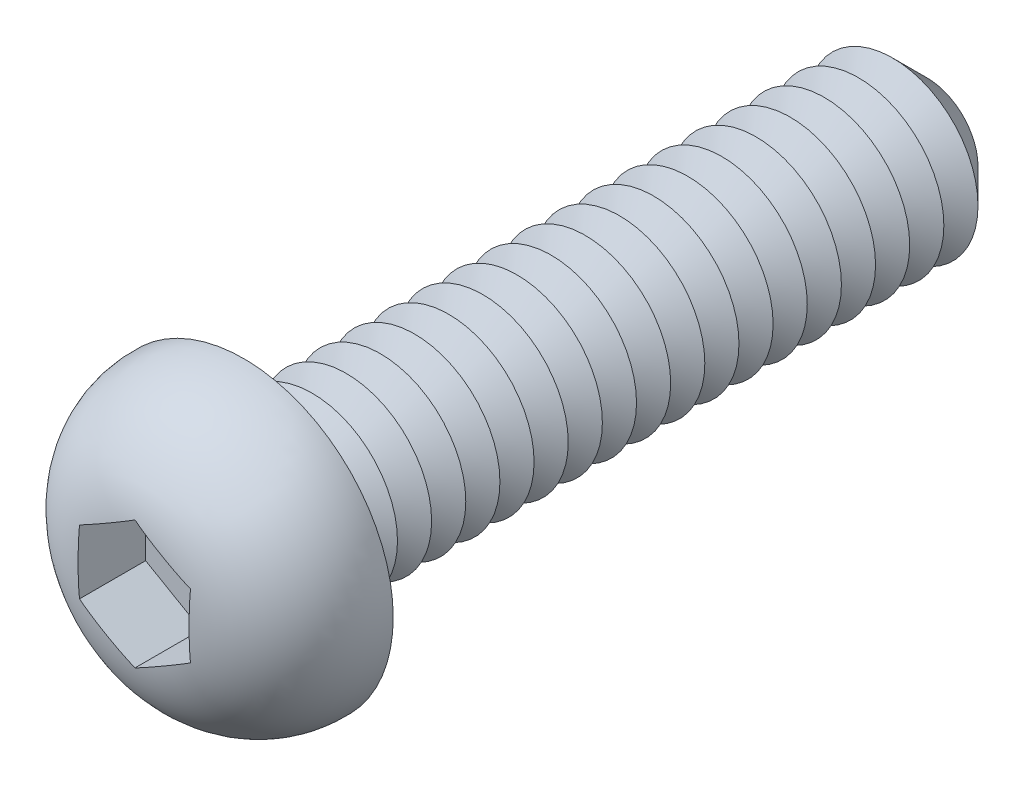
ISO-10303-21;
HEADER;
FILE_DESCRIPTION(('STEP AP214'),'2;1');
FILE_NAME('part.step','',(''),(''),'','','');
FILE_SCHEMA(('AUTOMOTIVE_DESIGN { 1 0 10303 214 1 1 1 1 }'));
ENDSEC;
DATA;
#1=APPLICATION_CONTEXT('core data for automotive mechanical design processes');
#2=APPLICATION_PROTOCOL_DEFINITION('international standard','automotive_design',2000,#1);
#3=PRODUCT_CONTEXT('',#1,'mechanical');
#4=PRODUCT('Part','Part','',(#3));
#5=PRODUCT_RELATED_PRODUCT_CATEGORY('part','',(#4));
#6=PRODUCT_DEFINITION_FORMATION('','',#4);
#7=PRODUCT_DEFINITION_CONTEXT('part definition',#1,'design');
#8=PRODUCT_DEFINITION('design','',#6,#7);
#9=PRODUCT_DEFINITION_SHAPE('','',#8);
#10=(LENGTH_UNIT() NAMED_UNIT(*) SI_UNIT(.MILLI.,.METRE.));
#11=(NAMED_UNIT(*) PLANE_ANGLE_UNIT() SI_UNIT($,.RADIAN.));
#12=(NAMED_UNIT(*) SI_UNIT($,.STERADIAN.) SOLID_ANGLE_UNIT());
#13=UNCERTAINTY_MEASURE_WITH_UNIT(LENGTH_MEASURE(1.E-05),#10,'distance_accuracy_value','');
#14=(GEOMETRIC_REPRESENTATION_CONTEXT(3) GLOBAL_UNCERTAINTY_ASSIGNED_CONTEXT((#13)) GLOBAL_UNIT_ASSIGNED_CONTEXT((#10,
#11,#12)) REPRESENTATION_CONTEXT('',''));
#15=CARTESIAN_POINT('',(0.,0.,0.));
#16=DIRECTION('',(0.,0.,1.));
#17=DIRECTION('',(1.,0.,0.));
#18=AXIS2_PLACEMENT_3D('',#15,#16,#17);
#19=CARTESIAN_POINT('',(0.,0.,-8.));
#20=DIRECTION('',(0.,0.,1.));
#21=DIRECTION('',(1.,0.,0.));
#22=AXIS2_PLACEMENT_3D('',#19,#20,#21);
#23=CYLINDRICAL_SURFACE('',#22,1.);
#24=CARTESIAN_POINT('',(0.,0.,-0.2));
#25=DIRECTION('',(0.,0.,1.));
#26=DIRECTION('',(1.,0.,0.));
#27=AXIS2_PLACEMENT_3D('',#24,#25,#26);
#28=CIRCLE('',#27,1.);
#29=CARTESIAN_POINT('',(1.,0.,-0.2));
#30=VERTEX_POINT('',#29);
#31=EDGE_CURVE('E48',#30,#30,#28,.F.);
#32=ORIENTED_EDGE('',*,*,#31,.T.);
#33=EDGE_LOOP('',(#32));
#34=FACE_BOUND('',#33,.T.);
#35=CARTESIAN_POINT('',(0.,0.,-0.399999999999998));
#36=DIRECTION('',(0.,0.,1.));
#37=DIRECTION('',(1.,0.,0.));
#38=AXIS2_PLACEMENT_3D('',#35,#36,#37);
#39=CIRCLE('',#38,1.);
#40=CARTESIAN_POINT('',(1.,0.,-0.399999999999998));
#41=VERTEX_POINT('',#40);
#42=EDGE_CURVE('E118',#41,#41,#39,.T.);
#43=ORIENTED_EDGE('',*,*,#42,.T.);
#44=EDGE_LOOP('',(#43));
#45=FACE_BOUND('',#44,.T.);
#46=ADVANCED_FACE('F39',(#34,#45),#23,.T.);
#47=CARTESIAN_POINT('',(0.,1.75,0.));
#48=DIRECTION('',(0.,0.,1.));
#49=DIRECTION('',(1.,0.,0.));
#50=AXIS2_PLACEMENT_3D('',#47,#48,#49);
#51=PLANE('',#50);
#52=CARTESIAN_POINT('',(0.,0.,0.));
#53=DIRECTION('',(0.,0.,1.));
#54=DIRECTION('',(1.,0.,0.));
#55=AXIS2_PLACEMENT_3D('',#52,#53,#54);
#56=CIRCLE('',#55,1.2);
#57=CARTESIAN_POINT('',(1.2,0.,0.));
#58=VERTEX_POINT('',#57);
#59=EDGE_CURVE('E11',#58,#58,#56,.T.);
#60=ORIENTED_EDGE('',*,*,#59,.T.);
#61=EDGE_LOOP('',(#60));
#62=FACE_BOUND('',#61,.T.);
#63=CARTESIAN_POINT('',(0.,0.,0.));
#64=DIRECTION('',(0.,0.,1.));
#65=DIRECTION('',(1.,0.,0.));
#66=AXIS2_PLACEMENT_3D('',#63,#64,#65);
#67=CIRCLE('',#66,1.75);
#68=CARTESIAN_POINT('',(1.75,0.,0.));
#69=VERTEX_POINT('',#68);
#70=EDGE_CURVE('E141',#69,#69,#67,.T.);
#71=ORIENTED_EDGE('',*,*,#70,.F.);
#72=EDGE_LOOP('',(#71));
#73=FACE_BOUND('',#72,.T.);
#74=ADVANCED_FACE('F219',(#62,#73),#51,.F.);
#75=CARTESIAN_POINT('',(0.,0.,0.0499999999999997));
#76=DIRECTION('',(0.,0.,1.));
#77=DIRECTION('',(1.,0.,0.));
#78=AXIS2_PLACEMENT_3D('',#75,#76,#77);
#79=DEGENERATE_TOROIDAL_SURFACE('',#78,0.50100040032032,1.25,.T.);
#80=CARTESIAN_POINT('',(-0.6502,0.375162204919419,1.2748120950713));
#81=CARTESIAN_POINT('',(-0.623166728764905,0.390769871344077,1.27799168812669));
#82=CARTESIAN_POINT('',(-0.596087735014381,0.406403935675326,1.28057383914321));
#83=CARTESIAN_POINT('',(-0.541883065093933,0.437699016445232,1.28476453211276));
#84=CARTESIAN_POINT('',(-0.514757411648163,0.453360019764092,1.28637345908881));
#85=CARTESIAN_POINT('',(-0.460533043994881,0.484666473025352,1.288838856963));
#86=CARTESIAN_POINT('',(-0.433434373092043,0.500311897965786,1.28969671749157));
#87=CARTESIAN_POINT('',(-0.379223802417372,0.531610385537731,1.29082127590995));
#88=CARTESIAN_POINT('',(-0.352111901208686,0.547263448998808,1.29108787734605));
#89=CARTESIAN_POINT('',(-0.297888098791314,0.578569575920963,1.29108787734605));
#90=CARTESIAN_POINT('',(-0.270776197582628,0.59422263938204,1.29082127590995));
#91=CARTESIAN_POINT('',(-0.216565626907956,0.625521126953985,1.28969671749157));
#92=CARTESIAN_POINT('',(-0.189466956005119,0.641166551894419,1.288838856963));
#93=CARTESIAN_POINT('',(-0.135242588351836,0.672473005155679,1.28637345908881));
#94=CARTESIAN_POINT('',(-0.108116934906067,0.688134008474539,1.28476453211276));
#95=CARTESIAN_POINT('',(-0.0539122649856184,0.719429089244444,1.28057383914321));
#96=CARTESIAN_POINT('',(-0.0268332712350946,0.735063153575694,1.27799168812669));
#97=CARTESIAN_POINT('',(0.000200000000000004,0.750670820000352,1.2748120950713));
#98=B_SPLINE_CURVE_WITH_KNOTS('',3,(#80,#81,#82,#83,#84,#85,#86,#87,#88,#89,#90,#91,#92,#93,#94,
#95,#96,#97),.UNSPECIFIED.,.F.,.F.,(4,2,2,2,2,2,2,2,4),(0.,0.0941133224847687,0.188189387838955,
0.282091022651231,0.376007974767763,0.469924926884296,0.563826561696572,0.657902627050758,
0.752015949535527),.UNSPECIFIED.);
#99=CARTESIAN_POINT('',(-0.65,0.375277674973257,1.27483563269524));
#100=VERTEX_POINT('',#99);
#101=CARTESIAN_POINT('',(0.,0.750555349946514,1.27483563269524));
#102=VERTEX_POINT('',#101);
#103=EDGE_CURVE('E158',#100,#102,#98,.T.);
#104=ORIENTED_EDGE('',*,*,#103,.T.);
#105=CARTESIAN_POINT('',(-0.000199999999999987,0.750670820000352,1.2748120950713));
#106=CARTESIAN_POINT('',(0.0268332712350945,0.735063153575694,1.27799168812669));
#107=CARTESIAN_POINT('',(0.0539122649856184,0.719429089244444,1.28057383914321));
#108=CARTESIAN_POINT('',(0.108116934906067,0.688134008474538,1.28476453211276));
#109=CARTESIAN_POINT('',(0.135242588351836,0.672473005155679,1.28637345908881));
#110=CARTESIAN_POINT('',(0.189466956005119,0.641166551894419,1.288838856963));
#111=CARTESIAN_POINT('',(0.216565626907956,0.625521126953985,1.28969671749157));
#112=CARTESIAN_POINT('',(0.270776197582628,0.59422263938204,1.29082127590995));
#113=CARTESIAN_POINT('',(0.297888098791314,0.578569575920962,1.29108787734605));
#114=CARTESIAN_POINT('',(0.352111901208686,0.547263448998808,1.29108787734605));
#115=CARTESIAN_POINT('',(0.379223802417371,0.531610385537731,1.29082127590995));
#116=CARTESIAN_POINT('',(0.433434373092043,0.500311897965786,1.28969671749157));
#117=CARTESIAN_POINT('',(0.46053304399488,0.484666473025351,1.288838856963));
#118=CARTESIAN_POINT('',(0.514757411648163,0.453360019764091,1.28637345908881));
#119=CARTESIAN_POINT('',(0.541883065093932,0.437699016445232,1.28476453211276));
#120=CARTESIAN_POINT('',(0.596087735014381,0.406403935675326,1.28057383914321));
#121=CARTESIAN_POINT('',(0.623166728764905,0.390769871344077,1.27799168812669));
#122=CARTESIAN_POINT('',(0.6502,0.375162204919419,1.2748120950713));
#123=B_SPLINE_CURVE_WITH_KNOTS('',3,(#105,#106,#107,#108,#109,#110,#111,#112,#113,#114,#115,
#116,#117,#118,#119,#120,#121,#122),.UNSPECIFIED.,.F.,.F.,(4,2,2,2,2,2,2,2,4),(0.,
0.0941133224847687,0.188189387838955,0.282091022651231,0.376007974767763,0.469924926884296,
0.563826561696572,0.657902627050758,0.752015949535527),.UNSPECIFIED.);
#124=CARTESIAN_POINT('',(0.65,0.375277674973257,1.27483563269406));
#125=VERTEX_POINT('',#124);
#126=EDGE_CURVE('E98',#102,#125,#123,.T.);
#127=ORIENTED_EDGE('',*,*,#126,.T.);
#128=CARTESIAN_POINT('',(0.65,0.,1.29108787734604));
#129=CARTESIAN_POINT('',(0.65,-0.0548046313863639,1.29109436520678));
#130=CARTESIAN_POINT('',(0.65,-0.109608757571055,1.29030350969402));
#131=CARTESIAN_POINT('',(0.65,-0.219170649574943,1.28661520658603));
#132=CARTESIAN_POINT('',(0.65,-0.273928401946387,1.28371727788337));
#133=CARTESIAN_POINT('',(0.65,-0.383095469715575,1.27460340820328));
#134=CARTESIAN_POINT('',(0.65,-0.437505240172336,1.26839356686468));
#135=CARTESIAN_POINT('',(0.65,-0.545599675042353,1.25147686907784));
#136=CARTESIAN_POINT('',(0.65,-0.599284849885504,1.24077336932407));
#137=CARTESIAN_POINT('',(0.65,-0.726147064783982,1.20871234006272));
#138=CARTESIAN_POINT('',(0.65,-0.79872007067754,1.18482363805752));
#139=CARTESIAN_POINT('',(0.65,-0.939044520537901,1.12544321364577));
#140=CARTESIAN_POINT('',(0.65,-1.00679500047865,1.08994917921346));
#141=CARTESIAN_POINT('',(0.65,-1.13535055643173,1.00723279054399));
#142=CARTESIAN_POINT('',(0.65,-1.19611172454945,0.959941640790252));
#143=CARTESIAN_POINT('',(0.65,-1.30775435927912,0.854818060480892));
#144=CARTESIAN_POINT('',(0.65,-1.35863681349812,0.796986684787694));
#145=CARTESIAN_POINT('',(0.65,-1.44408820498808,0.678594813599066));
#146=CARTESIAN_POINT('',(0.65,-1.4797502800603,0.618820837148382));
#147=CARTESIAN_POINT('',(0.65,-1.53998909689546,0.493937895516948));
#148=CARTESIAN_POINT('',(0.65,-1.56457069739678,0.428831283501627));
#149=CARTESIAN_POINT('',(0.65,-1.60096350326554,0.298259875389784));
#150=CARTESIAN_POINT('',(0.65,-1.61329238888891,0.232938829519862));
#151=CARTESIAN_POINT('',(0.65,-1.62664623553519,0.101147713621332));
#152=CARTESIAN_POINT('',(0.65,-1.6276715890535,0.0346776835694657));
#153=CARTESIAN_POINT('',(0.65,-1.6184464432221,-0.0965779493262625));
#154=CARTESIAN_POINT('',(0.65,-1.60834630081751,-0.161374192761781));
#155=CARTESIAN_POINT('',(0.65,-1.57743533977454,-0.288341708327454));
#156=CARTESIAN_POINT('',(0.65,-1.55662692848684,-0.350513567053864));
#157=CARTESIAN_POINT('',(0.65,-1.50490327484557,-0.470651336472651));
#158=CARTESIAN_POINT('',(0.65,-1.47396668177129,-0.528608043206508));
#159=CARTESIAN_POINT('',(0.65,-1.40295285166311,-0.63865943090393));
#160=CARTESIAN_POINT('',(0.65,-1.36286988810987,-0.690750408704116));
#161=CARTESIAN_POINT('',(0.65,-1.27395593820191,-0.788697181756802));
#162=CARTESIAN_POINT('',(0.65,-1.22497034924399,-0.834412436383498));
#163=CARTESIAN_POINT('',(0.65,-1.12042496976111,-0.917345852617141));
#164=CARTESIAN_POINT('',(0.65,-1.06487498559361,-0.954576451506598));
#165=CARTESIAN_POINT('',(0.65,-0.945822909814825,-1.02180899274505));
#166=CARTESIAN_POINT('',(0.65,-0.882060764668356,-1.05135028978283));
#167=CARTESIAN_POINT('',(0.65,-0.783687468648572,-1.08845195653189));
#168=CARTESIAN_POINT('',(0.65,-0.750379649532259,-1.09963089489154));
#169=CARTESIAN_POINT('',(0.65,-0.683093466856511,-1.11968224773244));
#170=CARTESIAN_POINT('',(0.65,-0.64911549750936,-1.12855597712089));
#171=CARTESIAN_POINT('',(0.65,-0.573025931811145,-1.14591124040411));
#172=CARTESIAN_POINT('',(0.65,-0.530794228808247,-1.15386155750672));
#173=CARTESIAN_POINT('',(0.65,-0.445896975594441,-1.16700727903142));
#174=CARTESIAN_POINT('',(0.65,-0.40323122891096,-1.17220137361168));
#175=CARTESIAN_POINT('',(0.65,-0.317562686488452,-1.18041063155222));
#176=CARTESIAN_POINT('',(0.65,-0.274559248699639,-1.18341875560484));
#177=CARTESIAN_POINT('',(0.65,-0.188468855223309,-1.18783962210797));
#178=CARTESIAN_POINT('',(0.65,-0.145381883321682,-1.1892520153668));
#179=CARTESIAN_POINT('',(0.65,-0.0590019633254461,-1.19095450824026));
#180=CARTESIAN_POINT('',(0.65,-0.0157089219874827,-1.19123978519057));
#181=CARTESIAN_POINT('',(0.65,0.0708684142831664,-1.1907952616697));
#182=CARTESIAN_POINT('',(0.65,0.114152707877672,-1.19006535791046));
#183=CARTESIAN_POINT('',(0.65,0.243756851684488,-1.18593769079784));
#184=CARTESIAN_POINT('',(0.65,0.330069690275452,-1.18060873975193));
#185=CARTESIAN_POINT('',(0.65,0.455654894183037,-1.16558903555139));
#186=CARTESIAN_POINT('',(0.65,0.495371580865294,-1.1597609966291));
#187=CARTESIAN_POINT('',(0.65,0.574346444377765,-1.14554740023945));
#188=CARTESIAN_POINT('',(0.65,0.613604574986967,-1.13716158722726));
#189=CARTESIAN_POINT('',(0.65,0.729813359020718,-1.10777161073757));
#190=CARTESIAN_POINT('',(0.65,0.805761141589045,-1.0824785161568));
#191=CARTESIAN_POINT('',(0.65,0.953092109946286,-1.01876094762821));
#192=CARTESIAN_POINT('',(0.65,1.02440985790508,-0.980183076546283));
#193=CARTESIAN_POINT('',(0.65,1.15871394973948,-0.890064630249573));
#194=CARTESIAN_POINT('',(0.65,1.22167627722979,-0.838487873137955));
#195=CARTESIAN_POINT('',(0.65,1.330165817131,-0.729868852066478));
#196=CARTESIAN_POINT('',(0.649999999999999,1.37682604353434,-0.673955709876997));
#197=CARTESIAN_POINT('',(0.649999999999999,1.45915796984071,-0.554638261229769));
#198=CARTESIAN_POINT('',(0.649999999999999,1.49484555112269,-0.491244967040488));
#199=CARTESIAN_POINT('',(0.649999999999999,1.55177809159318,-0.363813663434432));
#200=CARTESIAN_POINT('',(0.649999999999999,1.57388655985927,-0.300159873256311));
#201=CARTESIAN_POINT('',(0.649999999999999,1.60682450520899,-0.169982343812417));
#202=CARTESIAN_POINT('',(0.649999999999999,1.61765327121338,-0.103458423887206));
#203=CARTESIAN_POINT('',(0.649999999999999,1.62754441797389,0.0288862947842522));
#204=CARTESIAN_POINT('',(0.649999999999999,1.6268761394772,0.0946871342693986));
#205=CARTESIAN_POINT('',(0.649999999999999,1.61445465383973,0.225228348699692));
#206=CARTESIAN_POINT('',(0.649999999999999,1.60270257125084,0.289968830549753));
#207=CARTESIAN_POINT('',(0.649999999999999,1.56855547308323,0.416311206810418));
#208=CARTESIAN_POINT('',(0.649999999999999,1.54620091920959,0.477924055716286));
#209=CARTESIAN_POINT('',(0.649999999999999,1.49157336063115,0.596573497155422));
#210=CARTESIAN_POINT('',(0.649999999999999,1.459300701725,0.6536102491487));
#211=CARTESIAN_POINT('',(0.649999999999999,1.38544036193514,0.762206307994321));
#212=CARTESIAN_POINT('',(0.65,1.34375441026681,0.813698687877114));
#213=CARTESIAN_POINT('',(0.65,1.25257593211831,0.909229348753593));
#214=CARTESIAN_POINT('',(0.65,1.20308164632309,0.953265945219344));
#215=CARTESIAN_POINT('',(0.65,1.09600377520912,1.03435686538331));
#216=CARTESIAN_POINT('',(0.65,1.0382019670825,1.07112203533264));
#217=CARTESIAN_POINT('',(0.65,0.917680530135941,1.13527918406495));
#218=CARTESIAN_POINT('',(0.65,0.854963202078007,1.16267551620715));
#219=CARTESIAN_POINT('',(0.65,0.743153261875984,1.20242953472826));
#220=CARTESIAN_POINT('',(0.65,0.69477028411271,1.21684578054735));
#221=CARTESIAN_POINT('',(0.65,0.596867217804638,1.24115086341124));
#222=CARTESIAN_POINT('',(0.65,0.547346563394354,1.25103739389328));
#223=CARTESIAN_POINT('',(0.65,0.397729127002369,1.27492295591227));
#224=CARTESIAN_POINT('',(0.65,0.296733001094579,1.28309757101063));
#225=CARTESIAN_POINT('',(0.65,0.163130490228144,1.28863783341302));
#226=CARTESIAN_POINT('',(0.65,0.130510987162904,1.28957449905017));
#227=CARTESIAN_POINT('',(0.65,0.0652609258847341,1.29079749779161));
#228=CARTESIAN_POINT('',(0.65,0.0326303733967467,1.29108401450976));
#229=CARTESIAN_POINT('',(0.65,0.,1.29108787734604));
#230=B_SPLINE_CURVE_WITH_KNOTS('',3,(#128,#129,#130,#131,#132,#133,#134,#135,#136,#137,#138,
#139,#140,#141,#142,#143,#144,#145,#146,#147,#148,#149,#150,#151,#152,#153,#154,#155,#156,#157,
#158,#159,#160,#161,#162,#163,#164,#165,#166,#167,#168,#169,#170,#171,#172,#173,#174,#175,#176,
#177,#178,#179,#180,#181,#182,#183,#184,#185,#186,#187,#188,#189,#190,#191,#192,#193,#194,#195,
#196,#197,#198,#199,#200,#201,#202,#203,#204,#205,#206,#207,#208,#209,#210,#211,#212,#213,#214,
#215,#216,#217,#218,#219,#220,#221,#222,#223,#224,#225,#226,#227,#228,#229),.UNSPECIFIED.,.T.,
.F.,(4,2,2,2,2,2,2,2,2,2,2,2,2,2,2,2,2,2,2,2,2,2,2,2,2,2,2,2,2,2,2,2,2,2,2,2,2,2,2,2,2,2,2,2,2,
2,2,2,2,2,4),(0.,0.164404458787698,0.328846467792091,0.492986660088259,0.657004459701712,
0.885283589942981,1.11360822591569,1.34329681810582,1.57296243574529,1.78072081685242,
1.9883880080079,2.18685176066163,2.38530862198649,2.58111595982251,2.77687929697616,
2.97305799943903,3.16935986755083,3.36946935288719,3.5692835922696,3.77920028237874,
3.88453412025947,3.98980774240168,4.11861722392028,4.24748786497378,4.37677168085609,
4.50608378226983,4.63594858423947,4.76582660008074,5.02485743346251,5.14520715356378,
5.26556890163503,5.5046106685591,5.74651068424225,5.98909160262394,6.20640136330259,
6.42339510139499,6.62456294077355,6.82574346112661,7.02221748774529,7.21867158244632,
7.41438191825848,7.61008543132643,7.80793510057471,8.00582941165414,8.21046898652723,
8.41501334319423,8.56624321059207,8.71754999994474,9.02064941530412,9.11856257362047,
9.21644807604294),.UNSPECIFIED.);
#231=CARTESIAN_POINT('',(0.65,-0.375277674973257,1.27483563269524));
#232=VERTEX_POINT('',#231);
#233=EDGE_CURVE('E63',#125,#232,#230,.T.);
#234=ORIENTED_EDGE('',*,*,#233,.T.);
#235=CARTESIAN_POINT('',(0.6502,-0.375162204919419,1.2748120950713));
#236=CARTESIAN_POINT('',(0.623166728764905,-0.390769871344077,1.27799168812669));
#237=CARTESIAN_POINT('',(0.596087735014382,-0.406403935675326,1.28057383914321));
#238=CARTESIAN_POINT('',(0.541883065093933,-0.437699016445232,1.28476453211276));
#239=CARTESIAN_POINT('',(0.514757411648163,-0.453360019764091,1.28637345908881));
#240=CARTESIAN_POINT('',(0.460533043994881,-0.484666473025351,1.288838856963));
#241=CARTESIAN_POINT('',(0.433434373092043,-0.500311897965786,1.28969671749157));
#242=CARTESIAN_POINT('',(0.379223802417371,-0.531610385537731,1.29082127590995));
#243=CARTESIAN_POINT('',(0.352111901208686,-0.547263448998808,1.29108787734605));
#244=CARTESIAN_POINT('',(0.297888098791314,-0.578569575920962,1.29108787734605));
#245=CARTESIAN_POINT('',(0.270776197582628,-0.59422263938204,1.29082127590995));
#246=CARTESIAN_POINT('',(0.216565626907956,-0.625521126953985,1.28969671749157));
#247=CARTESIAN_POINT('',(0.189466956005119,-0.641166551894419,1.288838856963));
#248=CARTESIAN_POINT('',(0.135242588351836,-0.672473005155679,1.28637345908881));
#249=CARTESIAN_POINT('',(0.108116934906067,-0.688134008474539,1.28476453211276));
#250=CARTESIAN_POINT('',(0.0539122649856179,-0.719429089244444,1.28057383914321));
#251=CARTESIAN_POINT('',(0.026833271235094,-0.735063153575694,1.27799168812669));
#252=CARTESIAN_POINT('',(-0.000200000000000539,-0.750670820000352,1.2748120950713));
#253=B_SPLINE_CURVE_WITH_KNOTS('',3,(#235,#236,#237,#238,#239,#240,#241,#242,#243,#244,#245,
#246,#247,#248,#249,#250,#251,#252),.UNSPECIFIED.,.F.,.F.,(4,2,2,2,2,2,2,2,4),(0.,
0.0941133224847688,0.188189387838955,0.282091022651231,0.376007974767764,0.469924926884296,
0.563826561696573,0.657902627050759,0.752015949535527),.UNSPECIFIED.);
#254=CARTESIAN_POINT('',(0.,-0.750555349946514,1.27483563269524));
#255=VERTEX_POINT('',#254);
#256=EDGE_CURVE('E240',#232,#255,#253,.T.);
#257=ORIENTED_EDGE('',*,*,#256,.T.);
#258=CARTESIAN_POINT('',(0.000199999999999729,-0.750670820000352,1.2748120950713));
#259=CARTESIAN_POINT('',(-0.0268332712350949,-0.735063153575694,1.27799168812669));
#260=CARTESIAN_POINT('',(-0.0539122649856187,-0.719429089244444,1.28057383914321));
#261=CARTESIAN_POINT('',(-0.108116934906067,-0.688134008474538,1.28476453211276));
#262=CARTESIAN_POINT('',(-0.135242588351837,-0.672473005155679,1.28637345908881));
#263=CARTESIAN_POINT('',(-0.18946695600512,-0.641166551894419,1.288838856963));
#264=CARTESIAN_POINT('',(-0.216565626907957,-0.625521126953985,1.28969671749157));
#265=CARTESIAN_POINT('',(-0.270776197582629,-0.59422263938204,1.29082127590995));
#266=CARTESIAN_POINT('',(-0.297888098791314,-0.578569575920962,1.29108787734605));
#267=CARTESIAN_POINT('',(-0.352111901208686,-0.547263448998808,1.29108787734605));
#268=CARTESIAN_POINT('',(-0.379223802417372,-0.531610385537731,1.29082127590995));
#269=CARTESIAN_POINT('',(-0.433434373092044,-0.500311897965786,1.28969671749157));
#270=CARTESIAN_POINT('',(-0.460533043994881,-0.484666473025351,1.288838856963));
#271=CARTESIAN_POINT('',(-0.514757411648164,-0.453360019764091,1.28637345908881));
#272=CARTESIAN_POINT('',(-0.541883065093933,-0.437699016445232,1.28476453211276));
#273=CARTESIAN_POINT('',(-0.596087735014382,-0.406403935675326,1.28057383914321));
#274=CARTESIAN_POINT('',(-0.623166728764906,-0.390769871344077,1.27799168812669));
#275=CARTESIAN_POINT('',(-0.6502,-0.375162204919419,1.2748120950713));
#276=B_SPLINE_CURVE_WITH_KNOTS('',3,(#258,#259,#260,#261,#262,#263,#264,#265,#266,#267,#268,
#269,#270,#271,#272,#273,#274,#275),.UNSPECIFIED.,.F.,.F.,(4,2,2,2,2,2,2,2,4),(0.,
0.0941133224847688,0.188189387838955,0.282091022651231,0.376007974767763,0.469924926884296,
0.563826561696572,0.657902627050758,0.752015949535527),.UNSPECIFIED.);
#277=CARTESIAN_POINT('',(-0.65,-0.375277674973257,1.27483563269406));
#278=VERTEX_POINT('',#277);
#279=EDGE_CURVE('E246',#255,#278,#276,.T.);
#280=ORIENTED_EDGE('',*,*,#279,.T.);
#281=CARTESIAN_POINT('',(-0.65,0.,1.29108787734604));
#282=CARTESIAN_POINT('',(-0.65,0.0548046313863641,1.29109436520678));
#283=CARTESIAN_POINT('',(-0.65,0.109608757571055,1.29030350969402));
#284=CARTESIAN_POINT('',(-0.65,0.219170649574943,1.28661520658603));
#285=CARTESIAN_POINT('',(-0.65,0.273928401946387,1.28371727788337));
#286=CARTESIAN_POINT('',(-0.65,0.383095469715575,1.27460340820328));
#287=CARTESIAN_POINT('',(-0.65,0.437505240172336,1.26839356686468));
#288=CARTESIAN_POINT('',(-0.65,0.545599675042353,1.25147686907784));
#289=CARTESIAN_POINT('',(-0.65,0.599284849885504,1.24077336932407));
#290=CARTESIAN_POINT('',(-0.65,0.726147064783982,1.20871234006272));
#291=CARTESIAN_POINT('',(-0.65,0.79872007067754,1.18482363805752));
#292=CARTESIAN_POINT('',(-0.65,0.939044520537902,1.12544321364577));
#293=CARTESIAN_POINT('',(-0.65,1.00679500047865,1.08994917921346));
#294=CARTESIAN_POINT('',(-0.65,1.13535055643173,1.00723279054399));
#295=CARTESIAN_POINT('',(-0.65,1.19611172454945,0.959941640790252));
#296=CARTESIAN_POINT('',(-0.65,1.30775435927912,0.854818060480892));
#297=CARTESIAN_POINT('',(-0.649999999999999,1.35863681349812,0.796986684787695));
#298=CARTESIAN_POINT('',(-0.649999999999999,1.44408820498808,0.678594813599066));
#299=CARTESIAN_POINT('',(-0.649999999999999,1.4797502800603,0.618820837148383));
#300=CARTESIAN_POINT('',(-0.649999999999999,1.53998909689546,0.493937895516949));
#301=CARTESIAN_POINT('',(-0.649999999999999,1.56457069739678,0.428831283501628));
#302=CARTESIAN_POINT('',(-0.649999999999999,1.60096350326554,0.298259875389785));
#303=CARTESIAN_POINT('',(-0.649999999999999,1.61329238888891,0.232938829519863));
#304=CARTESIAN_POINT('',(-0.649999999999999,1.62664623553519,0.101147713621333));
#305=CARTESIAN_POINT('',(-0.649999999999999,1.6276715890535,0.0346776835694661));
#306=CARTESIAN_POINT('',(-0.649999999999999,1.6184464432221,-0.0965779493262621));
#307=CARTESIAN_POINT('',(-0.649999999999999,1.60834630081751,-0.16137419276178));
#308=CARTESIAN_POINT('',(-0.649999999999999,1.57743533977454,-0.288341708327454));
#309=CARTESIAN_POINT('',(-0.649999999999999,1.55662692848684,-0.350513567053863));
#310=CARTESIAN_POINT('',(-0.649999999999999,1.50490327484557,-0.47065133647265));
#311=CARTESIAN_POINT('',(-0.649999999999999,1.47396668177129,-0.528608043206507));
#312=CARTESIAN_POINT('',(-0.649999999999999,1.40295285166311,-0.638659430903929));
#313=CARTESIAN_POINT('',(-0.649999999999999,1.36286988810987,-0.690750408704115));
#314=CARTESIAN_POINT('',(-0.649999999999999,1.27395593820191,-0.788697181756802));
#315=CARTESIAN_POINT('',(-0.65,1.22497034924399,-0.834412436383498));
#316=CARTESIAN_POINT('',(-0.65,1.12042496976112,-0.91734585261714));
#317=CARTESIAN_POINT('',(-0.65,1.06487498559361,-0.954576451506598));
#318=CARTESIAN_POINT('',(-0.65,0.945822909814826,-1.02180899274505));
#319=CARTESIAN_POINT('',(-0.65,0.882060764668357,-1.05135028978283));
#320=CARTESIAN_POINT('',(-0.65,0.783687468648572,-1.08845195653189));
#321=CARTESIAN_POINT('',(-0.65,0.75037964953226,-1.09963089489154));
#322=CARTESIAN_POINT('',(-0.65,0.683093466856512,-1.11968224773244));
#323=CARTESIAN_POINT('',(-0.65,0.649115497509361,-1.12855597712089));
#324=CARTESIAN_POINT('',(-0.65,0.573025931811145,-1.14591124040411));
#325=CARTESIAN_POINT('',(-0.65,0.530794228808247,-1.15386155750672));
#326=CARTESIAN_POINT('',(-0.65,0.445896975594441,-1.16700727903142));
#327=CARTESIAN_POINT('',(-0.65,0.40323122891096,-1.17220137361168));
#328=CARTESIAN_POINT('',(-0.65,0.317562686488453,-1.18041063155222));
#329=CARTESIAN_POINT('',(-0.65,0.27455924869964,-1.18341875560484));
#330=CARTESIAN_POINT('',(-0.65,0.18846885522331,-1.18783962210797));
#331=CARTESIAN_POINT('',(-0.65,0.145381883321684,-1.1892520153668));
#332=CARTESIAN_POINT('',(-0.65,0.0590019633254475,-1.19095450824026));
#333=CARTESIAN_POINT('',(-0.65,0.0157089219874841,-1.19123978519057));
#334=CARTESIAN_POINT('',(-0.65,-0.070868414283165,-1.1907952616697));
#335=CARTESIAN_POINT('',(-0.65,-0.114152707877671,-1.19006535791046));
#336=CARTESIAN_POINT('',(-0.65,-0.243756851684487,-1.18593769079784));
#337=CARTESIAN_POINT('',(-0.65,-0.330069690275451,-1.18060873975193));
#338=CARTESIAN_POINT('',(-0.65,-0.455654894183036,-1.16558903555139));
#339=CARTESIAN_POINT('',(-0.65,-0.495371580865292,-1.1597609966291));
#340=CARTESIAN_POINT('',(-0.65,-0.574346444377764,-1.14554740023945));
#341=CARTESIAN_POINT('',(-0.65,-0.613604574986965,-1.13716158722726));
#342=CARTESIAN_POINT('',(-0.65,-0.729813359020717,-1.10777161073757));
#343=CARTESIAN_POINT('',(-0.65,-0.805761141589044,-1.0824785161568));
#344=CARTESIAN_POINT('',(-0.65,-0.953092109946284,-1.01876094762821));
#345=CARTESIAN_POINT('',(-0.65,-1.02440985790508,-0.980183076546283));
#346=CARTESIAN_POINT('',(-0.65,-1.15871394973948,-0.890064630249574));
#347=CARTESIAN_POINT('',(-0.65,-1.22167627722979,-0.838487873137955));
#348=CARTESIAN_POINT('',(-0.65,-1.330165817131,-0.729868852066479));
#349=CARTESIAN_POINT('',(-0.65,-1.37682604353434,-0.673955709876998));
#350=CARTESIAN_POINT('',(-0.65,-1.45915796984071,-0.55463826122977));
#351=CARTESIAN_POINT('',(-0.65,-1.49484555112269,-0.49124496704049));
#352=CARTESIAN_POINT('',(-0.65,-1.55177809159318,-0.363813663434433));
#353=CARTESIAN_POINT('',(-0.65,-1.57388655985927,-0.300159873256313));
#354=CARTESIAN_POINT('',(-0.65,-1.60682450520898,-0.169982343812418));
#355=CARTESIAN_POINT('',(-0.65,-1.61765327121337,-0.103458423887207));
#356=CARTESIAN_POINT('',(-0.65,-1.62754441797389,0.0288862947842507));
#357=CARTESIAN_POINT('',(-0.65,-1.6268761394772,0.0946871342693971));
#358=CARTESIAN_POINT('',(-0.65,-1.61445465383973,0.22522834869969));
#359=CARTESIAN_POINT('',(-0.65,-1.60270257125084,0.289968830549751));
#360=CARTESIAN_POINT('',(-0.65,-1.56855547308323,0.416311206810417));
#361=CARTESIAN_POINT('',(-0.65,-1.54620091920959,0.477924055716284));
#362=CARTESIAN_POINT('',(-0.65,-1.49157336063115,0.596573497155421));
#363=CARTESIAN_POINT('',(-0.65,-1.459300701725,0.653610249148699));
#364=CARTESIAN_POINT('',(-0.65,-1.38544036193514,0.762206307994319));
#365=CARTESIAN_POINT('',(-0.65,-1.34375441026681,0.813698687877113));
#366=CARTESIAN_POINT('',(-0.65,-1.25257593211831,0.909229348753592));
#367=CARTESIAN_POINT('',(-0.65,-1.20308164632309,0.953265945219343));
#368=CARTESIAN_POINT('',(-0.65,-1.09600377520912,1.03435686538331));
#369=CARTESIAN_POINT('',(-0.65,-1.0382019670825,1.07112203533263));
#370=CARTESIAN_POINT('',(-0.65,-0.917680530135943,1.13527918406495));
#371=CARTESIAN_POINT('',(-0.65,-0.854963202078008,1.16267551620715));
#372=CARTESIAN_POINT('',(-0.65,-0.743153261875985,1.20242953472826));
#373=CARTESIAN_POINT('',(-0.65,-0.694770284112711,1.21684578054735));
#374=CARTESIAN_POINT('',(-0.65,-0.596867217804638,1.24115086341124));
#375=CARTESIAN_POINT('',(-0.65,-0.547346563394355,1.25103739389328));
#376=CARTESIAN_POINT('',(-0.65,-0.39772912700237,1.27492295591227));
#377=CARTESIAN_POINT('',(-0.65,-0.296733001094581,1.28309757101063));
#378=CARTESIAN_POINT('',(-0.65,-0.163130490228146,1.28863783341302));
#379=CARTESIAN_POINT('',(-0.65,-0.130510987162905,1.28957449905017));
#380=CARTESIAN_POINT('',(-0.65,-0.0652609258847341,1.29079749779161));
#381=CARTESIAN_POINT('',(-0.65,-0.0326303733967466,1.29108401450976));
#382=CARTESIAN_POINT('',(-0.65,0.,1.29108787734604));
#383=B_SPLINE_CURVE_WITH_KNOTS('',3,(#281,#282,#283,#284,#285,#286,#287,#288,#289,#290,#291,
#292,#293,#294,#295,#296,#297,#298,#299,#300,#301,#302,#303,#304,#305,#306,#307,#308,#309,#310,
#311,#312,#313,#314,#315,#316,#317,#318,#319,#320,#321,#322,#323,#324,#325,#326,#327,#328,#329,
#330,#331,#332,#333,#334,#335,#336,#337,#338,#339,#340,#341,#342,#343,#344,#345,#346,#347,#348,
#349,#350,#351,#352,#353,#354,#355,#356,#357,#358,#359,#360,#361,#362,#363,#364,#365,#366,#367,
#368,#369,#370,#371,#372,#373,#374,#375,#376,#377,#378,#379,#380,#381,#382),.UNSPECIFIED.,.T.,
.F.,(4,2,2,2,2,2,2,2,2,2,2,2,2,2,2,2,2,2,2,2,2,2,2,2,2,2,2,2,2,2,2,2,2,2,2,2,2,2,2,2,2,2,2,2,2,
2,2,2,2,2,4),(0.,0.164404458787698,0.328846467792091,0.492986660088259,0.657004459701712,
0.885283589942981,1.11360822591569,1.34329681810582,1.57296243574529,1.78072081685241,
1.9883880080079,2.18685176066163,2.38530862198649,2.58111595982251,2.77687929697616,
2.97305799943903,3.16935986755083,3.36946935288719,3.5692835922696,3.77920028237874,
3.88453412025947,3.98980774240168,4.11861722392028,4.24748786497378,4.37677168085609,
4.50608378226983,4.63594858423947,4.76582660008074,5.02485743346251,5.14520715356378,
5.26556890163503,5.50461066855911,5.74651068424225,5.98909160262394,6.20640136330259,
6.42339510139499,6.62456294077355,6.82574346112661,7.02221748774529,7.21867158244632,
7.41438191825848,7.61008543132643,7.80793510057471,8.00582941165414,8.21046898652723,
8.41501334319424,8.56624321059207,8.71754999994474,9.02064941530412,9.11856257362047,
9.21644807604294),.UNSPECIFIED.);
#384=EDGE_CURVE('E166',#278,#100,#383,.T.);
#385=ORIENTED_EDGE('',*,*,#384,.T.);
#386=EDGE_LOOP('',(#104,#127,#234,#257,#280,#385));
#387=FACE_BOUND('',#386,.T.);
#388=ORIENTED_EDGE('',*,*,#70,.T.);
#389=EDGE_LOOP('',(#388));
#390=FACE_BOUND('',#389,.T.);
#391=ADVANCED_FACE('F171',(#387,#390),#79,.T.);
#392=CARTESIAN_POINT('',(0.65,0.375277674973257,0.5));
#393=DIRECTION('',(0.5,0.866025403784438,0.));
#394=DIRECTION('',(-0.866025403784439,0.5,0.));
#395=AXIS2_PLACEMENT_3D('',#392,#393,#394);
#396=PLANE('',#395);
#397=DIRECTION('',(0.,0.,1.));
#398=VECTOR('',#397,1.);
#399=CARTESIAN_POINT('',(0.,0.750555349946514,0.5));
#400=LINE('',#399,#398);
#401=CARTESIAN_POINT('',(0.,0.750555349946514,0.5));
#402=VERTEX_POINT('',#401);
#403=EDGE_CURVE('E55',#402,#102,#400,.T.);
#404=ORIENTED_EDGE('',*,*,#403,.F.);
#405=DIRECTION('',(-0.866025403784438,0.5,0.));
#406=VECTOR('',#405,1.);
#407=CARTESIAN_POINT('',(0.65,0.375277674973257,0.5));
#408=LINE('',#407,#406);
#409=CARTESIAN_POINT('',(0.65,0.375277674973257,0.5));
#410=VERTEX_POINT('',#409);
#411=EDGE_CURVE('E95',#410,#402,#408,.T.);
#412=ORIENTED_EDGE('',*,*,#411,.F.);
#413=DIRECTION('',(0.,0.,1.));
#414=VECTOR('',#413,1.);
#415=CARTESIAN_POINT('',(0.65,0.375277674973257,0.5));
#416=LINE('',#415,#414);
#417=EDGE_CURVE('E139',#410,#125,#416,.T.);
#418=ORIENTED_EDGE('',*,*,#417,.T.);
#419=ORIENTED_EDGE('',*,*,#126,.F.);
#420=EDGE_LOOP('',(#404,#412,#418,#419));
#421=FACE_BOUND('',#420,.T.);
#422=ADVANCED_FACE('F93',(#421),#396,.F.);
#423=CARTESIAN_POINT('',(0.65,-0.375277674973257,0.5));
#424=DIRECTION('',(1.,0.,0.));
#425=DIRECTION('',(0.,1.,0.));
#426=AXIS2_PLACEMENT_3D('',#423,#424,#425);
#427=PLANE('',#426);
#428=ORIENTED_EDGE('',*,*,#417,.F.);
#429=DIRECTION('',(0.,1.,0.));
#430=VECTOR('',#429,1.);
#431=CARTESIAN_POINT('',(0.65,-0.375277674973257,0.5));
#432=LINE('',#431,#430);
#433=CARTESIAN_POINT('',(0.65,-0.375277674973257,0.5));
#434=VERTEX_POINT('',#433);
#435=EDGE_CURVE('E102',#434,#410,#432,.T.);
#436=ORIENTED_EDGE('',*,*,#435,.F.);
#437=DIRECTION('',(0.,0.,1.));
#438=VECTOR('',#437,1.);
#439=CARTESIAN_POINT('',(0.65,-0.375277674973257,0.5));
#440=LINE('',#439,#438);
#441=EDGE_CURVE('E142',#434,#232,#440,.T.);
#442=ORIENTED_EDGE('',*,*,#441,.T.);
#443=ORIENTED_EDGE('',*,*,#233,.F.);
#444=EDGE_LOOP('',(#428,#436,#442,#443));
#445=FACE_BOUND('',#444,.T.);
#446=ADVANCED_FACE('F182',(#445),#427,.F.);
#447=CARTESIAN_POINT('',(0.,-0.750555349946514,0.5));
#448=DIRECTION('',(0.5,-0.866025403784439,0.));
#449=DIRECTION('',(0.866025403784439,0.5,0.));
#450=AXIS2_PLACEMENT_3D('',#447,#448,#449);
#451=PLANE('',#450);
#452=ORIENTED_EDGE('',*,*,#441,.F.);
#453=DIRECTION('',(0.866025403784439,0.5,0.));
#454=VECTOR('',#453,1.);
#455=CARTESIAN_POINT('',(0.,-0.750555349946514,0.5));
#456=LINE('',#455,#454);
#457=CARTESIAN_POINT('',(0.,-0.750555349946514,0.5));
#458=VERTEX_POINT('',#457);
#459=EDGE_CURVE('E134',#458,#434,#456,.T.);
#460=ORIENTED_EDGE('',*,*,#459,.F.);
#461=DIRECTION('',(0.,0.,1.));
#462=VECTOR('',#461,1.);
#463=CARTESIAN_POINT('',(0.,-0.750555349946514,0.5));
#464=LINE('',#463,#462);
#465=EDGE_CURVE('E145',#458,#255,#464,.T.);
#466=ORIENTED_EDGE('',*,*,#465,.T.);
#467=ORIENTED_EDGE('',*,*,#256,.F.);
#468=EDGE_LOOP('',(#452,#460,#466,#467));
#469=FACE_BOUND('',#468,.T.);
#470=ADVANCED_FACE('F234',(#469),#451,.F.);
#471=CARTESIAN_POINT('',(-0.65,-0.375277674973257,0.5));
#472=DIRECTION('',(-0.5,-0.866025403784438,0.));
#473=DIRECTION('',(0.866025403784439,-0.5,0.));
#474=AXIS2_PLACEMENT_3D('',#471,#472,#473);
#475=PLANE('',#474);
#476=ORIENTED_EDGE('',*,*,#465,.F.);
#477=DIRECTION('',(0.866025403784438,-0.5,0.));
#478=VECTOR('',#477,1.);
#479=CARTESIAN_POINT('',(-0.65,-0.375277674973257,0.5));
#480=LINE('',#479,#478);
#481=CARTESIAN_POINT('',(-0.65,-0.375277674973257,0.5));
#482=VERTEX_POINT('',#481);
#483=EDGE_CURVE('E130',#482,#458,#480,.T.);
#484=ORIENTED_EDGE('',*,*,#483,.F.);
#485=DIRECTION('',(0.,0.,1.));
#486=VECTOR('',#485,1.);
#487=CARTESIAN_POINT('',(-0.65,-0.375277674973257,0.5));
#488=LINE('',#487,#486);
#489=EDGE_CURVE('E149',#482,#278,#488,.T.);
#490=ORIENTED_EDGE('',*,*,#489,.T.);
#491=ORIENTED_EDGE('',*,*,#279,.F.);
#492=EDGE_LOOP('',(#476,#484,#490,#491));
#493=FACE_BOUND('',#492,.T.);
#494=ADVANCED_FACE('F237',(#493),#475,.F.);
#495=CARTESIAN_POINT('',(-0.65,0.375277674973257,0.5));
#496=DIRECTION('',(-1.,0.,0.));
#497=DIRECTION('',(0.,-1.,0.));
#498=AXIS2_PLACEMENT_3D('',#495,#496,#497);
#499=PLANE('',#498);
#500=ORIENTED_EDGE('',*,*,#489,.F.);
#501=DIRECTION('',(0.,-1.,0.));
#502=VECTOR('',#501,1.);
#503=CARTESIAN_POINT('',(-0.65,0.375277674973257,0.5));
#504=LINE('',#503,#502);
#505=CARTESIAN_POINT('',(-0.65,0.375277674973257,0.5));
#506=VERTEX_POINT('',#505);
#507=EDGE_CURVE('E112',#506,#482,#504,.T.);
#508=ORIENTED_EDGE('',*,*,#507,.F.);
#509=DIRECTION('',(0.,0.,1.));
#510=VECTOR('',#509,1.);
#511=CARTESIAN_POINT('',(-0.65,0.375277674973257,0.5));
#512=LINE('',#511,#510);
#513=EDGE_CURVE('E101',#506,#100,#512,.T.);
#514=ORIENTED_EDGE('',*,*,#513,.T.);
#515=ORIENTED_EDGE('',*,*,#384,.F.);
#516=EDGE_LOOP('',(#500,#508,#514,#515));
#517=FACE_BOUND('',#516,.T.);
#518=ADVANCED_FACE('F177',(#517),#499,.F.);
#519=CARTESIAN_POINT('',(0.,0.750555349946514,0.5));
#520=DIRECTION('',(-0.5,0.866025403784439,0.));
#521=DIRECTION('',(-0.866025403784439,-0.5,0.));
#522=AXIS2_PLACEMENT_3D('',#519,#520,#521);
#523=PLANE('',#522);
#524=ORIENTED_EDGE('',*,*,#513,.F.);
#525=DIRECTION('',(-0.866025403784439,-0.5,0.));
#526=VECTOR('',#525,1.);
#527=CARTESIAN_POINT('',(0.,0.750555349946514,0.5));
#528=LINE('',#527,#526);
#529=EDGE_CURVE('E105',#402,#506,#528,.T.);
#530=ORIENTED_EDGE('',*,*,#529,.F.);
#531=ORIENTED_EDGE('',*,*,#403,.T.);
#532=ORIENTED_EDGE('',*,*,#103,.F.);
#533=EDGE_LOOP('',(#524,#530,#531,#532));
#534=FACE_BOUND('',#533,.T.);
#535=ADVANCED_FACE('F106',(#534),#523,.F.);
#536=CARTESIAN_POINT('',(0.,0.,0.5));
#537=DIRECTION('',(0.,0.,1.));
#538=DIRECTION('',(1.,0.,0.));
#539=AXIS2_PLACEMENT_3D('',#536,#537,#538);
#540=PLANE('',#539);
#541=CARTESIAN_POINT('',(0.,0.,0.5));
#542=DIRECTION('',(0.,0.,1.));
#543=DIRECTION('',(1.,0.,0.));
#544=AXIS2_PLACEMENT_3D('',#541,#542,#543);
#545=CIRCLE('',#544,0.35);
#546=CARTESIAN_POINT('',(0.35,0.,0.5));
#547=VERTEX_POINT('',#546);
#548=EDGE_CURVE('E408',#547,#547,#545,.T.);
#549=ORIENTED_EDGE('',*,*,#548,.F.);
#550=EDGE_LOOP('',(#549));
#551=FACE_BOUND('',#550,.T.);
#552=ORIENTED_EDGE('',*,*,#411,.T.);
#553=ORIENTED_EDGE('',*,*,#529,.T.);
#554=ORIENTED_EDGE('',*,*,#507,.T.);
#555=ORIENTED_EDGE('',*,*,#483,.T.);
#556=ORIENTED_EDGE('',*,*,#459,.T.);
#557=ORIENTED_EDGE('',*,*,#435,.T.);
#558=EDGE_LOOP('',(#552,#553,#554,#555,#556,#557));
#559=FACE_BOUND('',#558,.T.);
#560=ADVANCED_FACE('F114',(#551,#559),#540,.T.);
#561=CARTESIAN_POINT('',(0.,0.,-0.399999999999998));
#562=DIRECTION('',(0.,0.,1.));
#563=DIRECTION('',(1.,0.,0.));
#564=AXIS2_PLACEMENT_3D('',#561,#562,#563);
#565=CONICAL_SURFACE('',#564,1.,1.04719755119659);
#566=CARTESIAN_POINT('',(0.,0.,-0.600000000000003));
#567=DIRECTION('',(0.,0.,1.));
#568=DIRECTION('',(1.,0.,0.));
#569=AXIS2_PLACEMENT_3D('',#566,#567,#568);
#570=CIRCLE('',#569,0.653589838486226);
#571=CARTESIAN_POINT('',(0.653589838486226,0.,-0.600000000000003));
#572=VERTEX_POINT('',#571);
#573=EDGE_CURVE('E124',#572,#572,#570,.T.);
#574=ORIENTED_EDGE('',*,*,#573,.T.);
#575=EDGE_LOOP('',(#574));
#576=FACE_BOUND('',#575,.T.);
#577=ORIENTED_EDGE('',*,*,#42,.F.);
#578=EDGE_LOOP('',(#577));
#579=FACE_BOUND('',#578,.T.);
#580=ADVANCED_FACE('F229',(#576,#579),#565,.T.);
#581=CARTESIAN_POINT('',(0.,0.,-0.600000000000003));
#582=DIRECTION('',(0.,0.,-1.));
#583=DIRECTION('',(-1.,0.,0.));
#584=AXIS2_PLACEMENT_3D('',#581,#582,#583);
#585=CONICAL_SURFACE('',#584,0.653589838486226,1.0471975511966);
#586=CARTESIAN_POINT('',(0.,0.,-0.799999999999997));
#587=DIRECTION('',(0.,0.,1.));
#588=DIRECTION('',(1.,0.,0.));
#589=AXIS2_PLACEMENT_3D('',#586,#587,#588);
#590=CIRCLE('',#589,1.);
#591=CARTESIAN_POINT('',(1.,0.,-0.799999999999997));
#592=VERTEX_POINT('',#591);
#593=EDGE_CURVE('E289',#592,#592,#590,.T.);
#594=ORIENTED_EDGE('',*,*,#593,.T.);
#595=EDGE_LOOP('',(#594));
#596=FACE_BOUND('',#595,.T.);
#597=ORIENTED_EDGE('',*,*,#573,.F.);
#598=EDGE_LOOP('',(#597));
#599=FACE_BOUND('',#598,.T.);
#600=ADVANCED_FACE('F559',(#596,#599),#585,.T.);
#601=CARTESIAN_POINT('',(0.,0.,-0.799999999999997));
#602=DIRECTION('',(0.,0.,1.));
#603=DIRECTION('',(1.,0.,0.));
#604=AXIS2_PLACEMENT_3D('',#601,#602,#603);
#605=CONICAL_SURFACE('',#604,1.,1.04719755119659);
#606=CARTESIAN_POINT('',(0.,0.,-1.));
#607=DIRECTION('',(0.,0.,1.));
#608=DIRECTION('',(1.,0.,0.));
#609=AXIS2_PLACEMENT_3D('',#606,#607,#608);
#610=CIRCLE('',#609,0.653589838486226);
#611=CARTESIAN_POINT('',(0.653589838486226,0.,-1.));
#612=VERTEX_POINT('',#611);
#613=EDGE_CURVE('E291',#612,#612,#610,.T.);
#614=ORIENTED_EDGE('',*,*,#613,.T.);
#615=EDGE_LOOP('',(#614));
#616=FACE_BOUND('',#615,.T.);
#617=ORIENTED_EDGE('',*,*,#593,.F.);
#618=EDGE_LOOP('',(#617));
#619=FACE_BOUND('',#618,.T.);
#620=ADVANCED_FACE('F555',(#616,#619),#605,.T.);
#621=CARTESIAN_POINT('',(0.,0.,-1.));
#622=DIRECTION('',(0.,0.,-1.));
#623=DIRECTION('',(-1.,0.,0.));
#624=AXIS2_PLACEMENT_3D('',#621,#622,#623);
#625=CONICAL_SURFACE('',#624,0.653589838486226,1.0471975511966);
#626=CARTESIAN_POINT('',(0.,0.,-1.2));
#627=DIRECTION('',(0.,0.,1.));
#628=DIRECTION('',(1.,0.,0.));
#629=AXIS2_PLACEMENT_3D('',#626,#627,#628);
#630=CIRCLE('',#629,1.);
#631=CARTESIAN_POINT('',(1.,0.,-1.2));
#632=VERTEX_POINT('',#631);
#633=EDGE_CURVE('E310',#632,#632,#630,.T.);
#634=ORIENTED_EDGE('',*,*,#633,.T.);
#635=EDGE_LOOP('',(#634));
#636=FACE_BOUND('',#635,.T.);
#637=ORIENTED_EDGE('',*,*,#613,.F.);
#638=EDGE_LOOP('',(#637));
#639=FACE_BOUND('',#638,.T.);
#640=ADVANCED_FACE('F551',(#636,#639),#625,.T.);
#641=CARTESIAN_POINT('',(0.,0.,-1.2));
#642=DIRECTION('',(0.,0.,1.));
#643=DIRECTION('',(1.,0.,0.));
#644=AXIS2_PLACEMENT_3D('',#641,#642,#643);
#645=CONICAL_SURFACE('',#644,1.,1.04719755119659);
#646=CARTESIAN_POINT('',(0.,0.,-1.4));
#647=DIRECTION('',(0.,0.,1.));
#648=DIRECTION('',(1.,0.,0.));
#649=AXIS2_PLACEMENT_3D('',#646,#647,#648);
#650=CIRCLE('',#649,0.653589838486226);
#651=CARTESIAN_POINT('',(0.653589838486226,0.,-1.4));
#652=VERTEX_POINT('',#651);
#653=EDGE_CURVE('E300',#652,#652,#650,.T.);
#654=ORIENTED_EDGE('',*,*,#653,.T.);
#655=EDGE_LOOP('',(#654));
#656=FACE_BOUND('',#655,.T.);
#657=ORIENTED_EDGE('',*,*,#633,.F.);
#658=EDGE_LOOP('',(#657));
#659=FACE_BOUND('',#658,.T.);
#660=ADVANCED_FACE('F547',(#656,#659),#645,.T.);
#661=CARTESIAN_POINT('',(0.,0.,-1.4));
#662=DIRECTION('',(0.,0.,-1.));
#663=DIRECTION('',(-1.,0.,0.));
#664=AXIS2_PLACEMENT_3D('',#661,#662,#663);
#665=CONICAL_SURFACE('',#664,0.653589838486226,1.0471975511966);
#666=CARTESIAN_POINT('',(0.,0.,-1.6));
#667=DIRECTION('',(0.,0.,1.));
#668=DIRECTION('',(1.,0.,0.));
#669=AXIS2_PLACEMENT_3D('',#666,#667,#668);
#670=CIRCLE('',#669,1.);
#671=CARTESIAN_POINT('',(1.,0.,-1.6));
#672=VERTEX_POINT('',#671);
#673=EDGE_CURVE('E297',#672,#672,#670,.T.);
#674=ORIENTED_EDGE('',*,*,#673,.T.);
#675=EDGE_LOOP('',(#674));
#676=FACE_BOUND('',#675,.T.);
#677=ORIENTED_EDGE('',*,*,#653,.F.);
#678=EDGE_LOOP('',(#677));
#679=FACE_BOUND('',#678,.T.);
#680=ADVANCED_FACE('F543',(#676,#679),#665,.T.);
#681=CARTESIAN_POINT('',(0.,0.,-1.6));
#682=DIRECTION('',(0.,0.,1.));
#683=DIRECTION('',(1.,0.,0.));
#684=AXIS2_PLACEMENT_3D('',#681,#682,#683);
#685=CONICAL_SURFACE('',#684,1.,1.04719755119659);
#686=CARTESIAN_POINT('',(0.,0.,-1.8));
#687=DIRECTION('',(0.,0.,1.));
#688=DIRECTION('',(1.,0.,0.));
#689=AXIS2_PLACEMENT_3D('',#686,#687,#688);
#690=CIRCLE('',#689,0.653589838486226);
#691=CARTESIAN_POINT('',(0.653589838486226,0.,-1.8));
#692=VERTEX_POINT('',#691);
#693=EDGE_CURVE('E301',#692,#692,#690,.T.);
#694=ORIENTED_EDGE('',*,*,#693,.T.);
#695=EDGE_LOOP('',(#694));
#696=FACE_BOUND('',#695,.T.);
#697=ORIENTED_EDGE('',*,*,#673,.F.);
#698=EDGE_LOOP('',(#697));
#699=FACE_BOUND('',#698,.T.);
#700=ADVANCED_FACE('F539',(#696,#699),#685,.T.);
#701=CARTESIAN_POINT('',(0.,0.,-1.8));
#702=DIRECTION('',(0.,0.,-1.));
#703=DIRECTION('',(-1.,0.,0.));
#704=AXIS2_PLACEMENT_3D('',#701,#702,#703);
#705=CONICAL_SURFACE('',#704,0.653589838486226,1.0471975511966);
#706=CARTESIAN_POINT('',(0.,0.,-2.));
#707=DIRECTION('',(0.,0.,1.));
#708=DIRECTION('',(1.,0.,0.));
#709=AXIS2_PLACEMENT_3D('',#706,#707,#708);
#710=CIRCLE('',#709,1.);
#711=CARTESIAN_POINT('',(1.,0.,-2.));
#712=VERTEX_POINT('',#711);
#713=EDGE_CURVE('E320',#712,#712,#710,.T.);
#714=ORIENTED_EDGE('',*,*,#713,.T.);
#715=EDGE_LOOP('',(#714));
#716=FACE_BOUND('',#715,.T.);
#717=ORIENTED_EDGE('',*,*,#693,.F.);
#718=EDGE_LOOP('',(#717));
#719=FACE_BOUND('',#718,.T.);
#720=ADVANCED_FACE('F535',(#716,#719),#705,.T.);
#721=CARTESIAN_POINT('',(0.,0.,-2.));
#722=DIRECTION('',(0.,0.,1.));
#723=DIRECTION('',(1.,0.,0.));
#724=AXIS2_PLACEMENT_3D('',#721,#722,#723);
#725=CONICAL_SURFACE('',#724,1.,1.04719755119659);
#726=CARTESIAN_POINT('',(0.,0.,-2.2));
#727=DIRECTION('',(0.,0.,1.));
#728=DIRECTION('',(1.,0.,0.));
#729=AXIS2_PLACEMENT_3D('',#726,#727,#728);
#730=CIRCLE('',#729,0.653589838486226);
#731=CARTESIAN_POINT('',(0.653589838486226,0.,-2.2));
#732=VERTEX_POINT('',#731);
#733=EDGE_CURVE('E324',#732,#732,#730,.T.);
#734=ORIENTED_EDGE('',*,*,#733,.T.);
#735=EDGE_LOOP('',(#734));
#736=FACE_BOUND('',#735,.T.);
#737=ORIENTED_EDGE('',*,*,#713,.F.);
#738=EDGE_LOOP('',(#737));
#739=FACE_BOUND('',#738,.T.);
#740=ADVANCED_FACE('F531',(#736,#739),#725,.T.);
#741=CARTESIAN_POINT('',(0.,0.,-2.2));
#742=DIRECTION('',(0.,0.,-1.));
#743=DIRECTION('',(-1.,0.,0.));
#744=AXIS2_PLACEMENT_3D('',#741,#742,#743);
#745=CONICAL_SURFACE('',#744,0.653589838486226,1.0471975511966);
#746=CARTESIAN_POINT('',(0.,0.,-2.4));
#747=DIRECTION('',(0.,0.,1.));
#748=DIRECTION('',(1.,0.,0.));
#749=AXIS2_PLACEMENT_3D('',#746,#747,#748);
#750=CIRCLE('',#749,1.);
#751=CARTESIAN_POINT('',(1.,0.,-2.4));
#752=VERTEX_POINT('',#751);
#753=EDGE_CURVE('E328',#752,#752,#750,.T.);
#754=ORIENTED_EDGE('',*,*,#753,.T.);
#755=EDGE_LOOP('',(#754));
#756=FACE_BOUND('',#755,.T.);
#757=ORIENTED_EDGE('',*,*,#733,.F.);
#758=EDGE_LOOP('',(#757));
#759=FACE_BOUND('',#758,.T.);
#760=ADVANCED_FACE('F527',(#756,#759),#745,.T.);
#761=CARTESIAN_POINT('',(0.,0.,-2.4));
#762=DIRECTION('',(0.,0.,1.));
#763=DIRECTION('',(1.,0.,0.));
#764=AXIS2_PLACEMENT_3D('',#761,#762,#763);
#765=CONICAL_SURFACE('',#764,1.,1.04719755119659);
#766=CARTESIAN_POINT('',(0.,0.,-2.6));
#767=DIRECTION('',(0.,0.,1.));
#768=DIRECTION('',(1.,0.,0.));
#769=AXIS2_PLACEMENT_3D('',#766,#767,#768);
#770=CIRCLE('',#769,0.653589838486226);
#771=CARTESIAN_POINT('',(0.653589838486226,0.,-2.6));
#772=VERTEX_POINT('',#771);
#773=EDGE_CURVE('E332',#772,#772,#770,.T.);
#774=ORIENTED_EDGE('',*,*,#773,.T.);
#775=EDGE_LOOP('',(#774));
#776=FACE_BOUND('',#775,.T.);
#777=ORIENTED_EDGE('',*,*,#753,.F.);
#778=EDGE_LOOP('',(#777));
#779=FACE_BOUND('',#778,.T.);
#780=ADVANCED_FACE('F523',(#776,#779),#765,.T.);
#781=CARTESIAN_POINT('',(0.,0.,-2.6));
#782=DIRECTION('',(0.,0.,-1.));
#783=DIRECTION('',(-1.,0.,0.));
#784=AXIS2_PLACEMENT_3D('',#781,#782,#783);
#785=CONICAL_SURFACE('',#784,0.653589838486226,1.0471975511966);
#786=CARTESIAN_POINT('',(0.,0.,-2.8));
#787=DIRECTION('',(0.,0.,1.));
#788=DIRECTION('',(1.,0.,0.));
#789=AXIS2_PLACEMENT_3D('',#786,#787,#788);
#790=CIRCLE('',#789,1.);
#791=CARTESIAN_POINT('',(1.,0.,-2.8));
#792=VERTEX_POINT('',#791);
#793=EDGE_CURVE('E264',#792,#792,#790,.T.);
#794=ORIENTED_EDGE('',*,*,#793,.T.);
#795=EDGE_LOOP('',(#794));
#796=FACE_BOUND('',#795,.T.);
#797=ORIENTED_EDGE('',*,*,#773,.F.);
#798=EDGE_LOOP('',(#797));
#799=FACE_BOUND('',#798,.T.);
#800=ADVANCED_FACE('F519',(#796,#799),#785,.T.);
#801=CARTESIAN_POINT('',(0.,0.,-2.8));
#802=DIRECTION('',(0.,0.,1.));
#803=DIRECTION('',(1.,0.,0.));
#804=AXIS2_PLACEMENT_3D('',#801,#802,#803);
#805=CONICAL_SURFACE('',#804,1.,1.04719755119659);
#806=CARTESIAN_POINT('',(0.,0.,-3.));
#807=DIRECTION('',(0.,0.,1.));
#808=DIRECTION('',(1.,0.,0.));
#809=AXIS2_PLACEMENT_3D('',#806,#807,#808);
#810=CIRCLE('',#809,0.653589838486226);
#811=CARTESIAN_POINT('',(0.653589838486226,0.,-3.));
#812=VERTEX_POINT('',#811);
#813=EDGE_CURVE('E338',#812,#812,#810,.T.);
#814=ORIENTED_EDGE('',*,*,#813,.T.);
#815=EDGE_LOOP('',(#814));
#816=FACE_BOUND('',#815,.T.);
#817=ORIENTED_EDGE('',*,*,#793,.F.);
#818=EDGE_LOOP('',(#817));
#819=FACE_BOUND('',#818,.T.);
#820=ADVANCED_FACE('F515',(#816,#819),#805,.T.);
#821=CARTESIAN_POINT('',(0.,0.,-3.));
#822=DIRECTION('',(0.,0.,-1.));
#823=DIRECTION('',(-1.,0.,0.));
#824=AXIS2_PLACEMENT_3D('',#821,#822,#823);
#825=CONICAL_SURFACE('',#824,0.653589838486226,1.0471975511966);
#826=CARTESIAN_POINT('',(0.,0.,-3.2));
#827=DIRECTION('',(0.,0.,1.));
#828=DIRECTION('',(1.,0.,0.));
#829=AXIS2_PLACEMENT_3D('',#826,#827,#828);
#830=CIRCLE('',#829,1.);
#831=CARTESIAN_POINT('',(1.,0.,-3.2));
#832=VERTEX_POINT('',#831);
#833=EDGE_CURVE('E341',#832,#832,#830,.T.);
#834=ORIENTED_EDGE('',*,*,#833,.T.);
#835=EDGE_LOOP('',(#834));
#836=FACE_BOUND('',#835,.T.);
#837=ORIENTED_EDGE('',*,*,#813,.F.);
#838=EDGE_LOOP('',(#837));
#839=FACE_BOUND('',#838,.T.);
#840=ADVANCED_FACE('F511',(#836,#839),#825,.T.);
#841=CARTESIAN_POINT('',(0.,0.,-3.2));
#842=DIRECTION('',(0.,0.,1.));
#843=DIRECTION('',(1.,0.,0.));
#844=AXIS2_PLACEMENT_3D('',#841,#842,#843);
#845=CONICAL_SURFACE('',#844,1.,1.04719755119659);
#846=CARTESIAN_POINT('',(0.,0.,-3.4));
#847=DIRECTION('',(0.,0.,1.));
#848=DIRECTION('',(1.,0.,0.));
#849=AXIS2_PLACEMENT_3D('',#846,#847,#848);
#850=CIRCLE('',#849,0.653589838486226);
#851=CARTESIAN_POINT('',(0.653589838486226,0.,-3.4));
#852=VERTEX_POINT('',#851);
#853=EDGE_CURVE('E345',#852,#852,#850,.T.);
#854=ORIENTED_EDGE('',*,*,#853,.T.);
#855=EDGE_LOOP('',(#854));
#856=FACE_BOUND('',#855,.T.);
#857=ORIENTED_EDGE('',*,*,#833,.F.);
#858=EDGE_LOOP('',(#857));
#859=FACE_BOUND('',#858,.T.);
#860=ADVANCED_FACE('F507',(#856,#859),#845,.T.);
#861=CARTESIAN_POINT('',(0.,0.,-3.4));
#862=DIRECTION('',(0.,0.,-1.));
#863=DIRECTION('',(-1.,0.,0.));
#864=AXIS2_PLACEMENT_3D('',#861,#862,#863);
#865=CONICAL_SURFACE('',#864,0.653589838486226,1.0471975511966);
#866=CARTESIAN_POINT('',(0.,0.,-3.6));
#867=DIRECTION('',(0.,0.,1.));
#868=DIRECTION('',(1.,0.,0.));
#869=AXIS2_PLACEMENT_3D('',#866,#867,#868);
#870=CIRCLE('',#869,1.);
#871=CARTESIAN_POINT('',(1.,0.,-3.6));
#872=VERTEX_POINT('',#871);
#873=EDGE_CURVE('E348',#872,#872,#870,.T.);
#874=ORIENTED_EDGE('',*,*,#873,.T.);
#875=EDGE_LOOP('',(#874));
#876=FACE_BOUND('',#875,.T.);
#877=ORIENTED_EDGE('',*,*,#853,.F.);
#878=EDGE_LOOP('',(#877));
#879=FACE_BOUND('',#878,.T.);
#880=ADVANCED_FACE('F503',(#876,#879),#865,.T.);
#881=CARTESIAN_POINT('',(0.,0.,-3.6));
#882=DIRECTION('',(0.,0.,1.));
#883=DIRECTION('',(1.,0.,0.));
#884=AXIS2_PLACEMENT_3D('',#881,#882,#883);
#885=CONICAL_SURFACE('',#884,1.,1.04719755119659);
#886=CARTESIAN_POINT('',(0.,0.,-3.8));
#887=DIRECTION('',(0.,0.,1.));
#888=DIRECTION('',(1.,0.,0.));
#889=AXIS2_PLACEMENT_3D('',#886,#887,#888);
#890=CIRCLE('',#889,0.653589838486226);
#891=CARTESIAN_POINT('',(0.653589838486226,0.,-3.8));
#892=VERTEX_POINT('',#891);
#893=EDGE_CURVE('E274',#892,#892,#890,.T.);
#894=ORIENTED_EDGE('',*,*,#893,.T.);
#895=EDGE_LOOP('',(#894));
#896=FACE_BOUND('',#895,.T.);
#897=ORIENTED_EDGE('',*,*,#873,.F.);
#898=EDGE_LOOP('',(#897));
#899=FACE_BOUND('',#898,.T.);
#900=ADVANCED_FACE('F499',(#896,#899),#885,.T.);
#901=CARTESIAN_POINT('',(0.,0.,-3.8));
#902=DIRECTION('',(0.,0.,-1.));
#903=DIRECTION('',(-1.,0.,0.));
#904=AXIS2_PLACEMENT_3D('',#901,#902,#903);
#905=CONICAL_SURFACE('',#904,0.653589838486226,1.0471975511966);
#906=CARTESIAN_POINT('',(0.,0.,-4.));
#907=DIRECTION('',(0.,0.,1.));
#908=DIRECTION('',(1.,0.,0.));
#909=AXIS2_PLACEMENT_3D('',#906,#907,#908);
#910=CIRCLE('',#909,1.);
#911=CARTESIAN_POINT('',(1.,0.,-4.));
#912=VERTEX_POINT('',#911);
#913=EDGE_CURVE('E272',#912,#912,#910,.T.);
#914=ORIENTED_EDGE('',*,*,#913,.T.);
#915=EDGE_LOOP('',(#914));
#916=FACE_BOUND('',#915,.T.);
#917=ORIENTED_EDGE('',*,*,#893,.F.);
#918=EDGE_LOOP('',(#917));
#919=FACE_BOUND('',#918,.T.);
#920=ADVANCED_FACE('F495',(#916,#919),#905,.T.);
#921=CARTESIAN_POINT('',(0.,0.,-4.));
#922=DIRECTION('',(0.,0.,1.));
#923=DIRECTION('',(1.,0.,0.));
#924=AXIS2_PLACEMENT_3D('',#921,#922,#923);
#925=CONICAL_SURFACE('',#924,1.,1.04719755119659);
#926=CARTESIAN_POINT('',(0.,0.,-4.2));
#927=DIRECTION('',(0.,0.,1.));
#928=DIRECTION('',(1.,0.,0.));
#929=AXIS2_PLACEMENT_3D('',#926,#927,#928);
#930=CIRCLE('',#929,0.653589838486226);
#931=CARTESIAN_POINT('',(0.653589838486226,0.,-4.2));
#932=VERTEX_POINT('',#931);
#933=EDGE_CURVE('E269',#932,#932,#930,.T.);
#934=ORIENTED_EDGE('',*,*,#933,.T.);
#935=EDGE_LOOP('',(#934));
#936=FACE_BOUND('',#935,.T.);
#937=ORIENTED_EDGE('',*,*,#913,.F.);
#938=EDGE_LOOP('',(#937));
#939=FACE_BOUND('',#938,.T.);
#940=ADVANCED_FACE('F491',(#936,#939),#925,.T.);
#941=CARTESIAN_POINT('',(0.,0.,-4.2));
#942=DIRECTION('',(0.,0.,-1.));
#943=DIRECTION('',(-1.,0.,0.));
#944=AXIS2_PLACEMENT_3D('',#941,#942,#943);
#945=CONICAL_SURFACE('',#944,0.653589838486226,1.0471975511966);
#946=CARTESIAN_POINT('',(0.,0.,-4.4));
#947=DIRECTION('',(0.,0.,1.));
#948=DIRECTION('',(1.,0.,0.));
#949=AXIS2_PLACEMENT_3D('',#946,#947,#948);
#950=CIRCLE('',#949,1.);
#951=CARTESIAN_POINT('',(1.,0.,-4.4));
#952=VERTEX_POINT('',#951);
#953=EDGE_CURVE('E266',#952,#952,#950,.T.);
#954=ORIENTED_EDGE('',*,*,#953,.T.);
#955=EDGE_LOOP('',(#954));
#956=FACE_BOUND('',#955,.T.);
#957=ORIENTED_EDGE('',*,*,#933,.F.);
#958=EDGE_LOOP('',(#957));
#959=FACE_BOUND('',#958,.T.);
#960=ADVANCED_FACE('F487',(#956,#959),#945,.T.);
#961=CARTESIAN_POINT('',(0.,0.,-4.4));
#962=DIRECTION('',(0.,0.,1.));
#963=DIRECTION('',(1.,0.,0.));
#964=AXIS2_PLACEMENT_3D('',#961,#962,#963);
#965=CONICAL_SURFACE('',#964,1.,1.04719755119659);
#966=CARTESIAN_POINT('',(0.,0.,-4.6));
#967=DIRECTION('',(0.,0.,1.));
#968=DIRECTION('',(1.,0.,0.));
#969=AXIS2_PLACEMENT_3D('',#966,#967,#968);
#970=CIRCLE('',#969,0.653589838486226);
#971=CARTESIAN_POINT('',(0.653589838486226,0.,-4.6));
#972=VERTEX_POINT('',#971);
#973=EDGE_CURVE('E270',#972,#972,#970,.T.);
#974=ORIENTED_EDGE('',*,*,#973,.T.);
#975=EDGE_LOOP('',(#974));
#976=FACE_BOUND('',#975,.T.);
#977=ORIENTED_EDGE('',*,*,#953,.F.);
#978=EDGE_LOOP('',(#977));
#979=FACE_BOUND('',#978,.T.);
#980=ADVANCED_FACE('F483',(#976,#979),#965,.T.);
#981=CARTESIAN_POINT('',(0.,0.,-4.6));
#982=DIRECTION('',(0.,0.,-1.));
#983=DIRECTION('',(-1.,0.,0.));
#984=AXIS2_PLACEMENT_3D('',#981,#982,#983);
#985=CONICAL_SURFACE('',#984,0.653589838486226,1.0471975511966);
#986=CARTESIAN_POINT('',(0.,0.,-4.8));
#987=DIRECTION('',(0.,0.,1.));
#988=DIRECTION('',(1.,0.,0.));
#989=AXIS2_PLACEMENT_3D('',#986,#987,#988);
#990=CIRCLE('',#989,1.);
#991=CARTESIAN_POINT('',(1.,0.,-4.8));
#992=VERTEX_POINT('',#991);
#993=EDGE_CURVE('E358',#992,#992,#990,.T.);
#994=ORIENTED_EDGE('',*,*,#993,.T.);
#995=EDGE_LOOP('',(#994));
#996=FACE_BOUND('',#995,.T.);
#997=ORIENTED_EDGE('',*,*,#973,.F.);
#998=EDGE_LOOP('',(#997));
#999=FACE_BOUND('',#998,.T.);
#1000=ADVANCED_FACE('F479',(#996,#999),#985,.T.);
#1001=CARTESIAN_POINT('',(0.,0.,-4.8));
#1002=DIRECTION('',(0.,0.,1.));
#1003=DIRECTION('',(1.,0.,0.));
#1004=AXIS2_PLACEMENT_3D('',#1001,#1002,#1003);
#1005=CONICAL_SURFACE('',#1004,1.,1.04719755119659);
#1006=CARTESIAN_POINT('',(0.,0.,-5.));
#1007=DIRECTION('',(0.,0.,1.));
#1008=DIRECTION('',(1.,0.,0.));
#1009=AXIS2_PLACEMENT_3D('',#1006,#1007,#1008);
#1010=CIRCLE('',#1009,0.653589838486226);
#1011=CARTESIAN_POINT('',(0.653589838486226,0.,-5.));
#1012=VERTEX_POINT('',#1011);
#1013=EDGE_CURVE('E362',#1012,#1012,#1010,.T.);
#1014=ORIENTED_EDGE('',*,*,#1013,.T.);
#1015=EDGE_LOOP('',(#1014));
#1016=FACE_BOUND('',#1015,.T.);
#1017=ORIENTED_EDGE('',*,*,#993,.F.);
#1018=EDGE_LOOP('',(#1017));
#1019=FACE_BOUND('',#1018,.T.);
#1020=ADVANCED_FACE('F475',(#1016,#1019),#1005,.T.);
#1021=CARTESIAN_POINT('',(0.,0.,-5.));
#1022=DIRECTION('',(0.,0.,-1.));
#1023=DIRECTION('',(-1.,0.,0.));
#1024=AXIS2_PLACEMENT_3D('',#1021,#1022,#1023);
#1025=CONICAL_SURFACE('',#1024,0.653589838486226,1.0471975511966);
#1026=CARTESIAN_POINT('',(0.,0.,-5.2));
#1027=DIRECTION('',(0.,0.,1.));
#1028=DIRECTION('',(1.,0.,0.));
#1029=AXIS2_PLACEMENT_3D('',#1026,#1027,#1028);
#1030=CIRCLE('',#1029,1.);
#1031=CARTESIAN_POINT('',(1.,0.,-5.2));
#1032=VERTEX_POINT('',#1031);
#1033=EDGE_CURVE('E365',#1032,#1032,#1030,.T.);
#1034=ORIENTED_EDGE('',*,*,#1033,.T.);
#1035=EDGE_LOOP('',(#1034));
#1036=FACE_BOUND('',#1035,.T.);
#1037=ORIENTED_EDGE('',*,*,#1013,.F.);
#1038=EDGE_LOOP('',(#1037));
#1039=FACE_BOUND('',#1038,.T.);
#1040=ADVANCED_FACE('F471',(#1036,#1039),#1025,.T.);
#1041=CARTESIAN_POINT('',(0.,0.,-5.2));
#1042=DIRECTION('',(0.,0.,1.));
#1043=DIRECTION('',(1.,0.,0.));
#1044=AXIS2_PLACEMENT_3D('',#1041,#1042,#1043);
#1045=CONICAL_SURFACE('',#1044,1.,1.04719755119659);
#1046=CARTESIAN_POINT('',(0.,0.,-5.4));
#1047=DIRECTION('',(0.,0.,1.));
#1048=DIRECTION('',(1.,0.,0.));
#1049=AXIS2_PLACEMENT_3D('',#1046,#1047,#1048);
#1050=CIRCLE('',#1049,0.653589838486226);
#1051=CARTESIAN_POINT('',(0.653589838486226,0.,-5.4));
#1052=VERTEX_POINT('',#1051);
#1053=EDGE_CURVE('E369',#1052,#1052,#1050,.T.);
#1054=ORIENTED_EDGE('',*,*,#1053,.T.);
#1055=EDGE_LOOP('',(#1054));
#1056=FACE_BOUND('',#1055,.T.);
#1057=ORIENTED_EDGE('',*,*,#1033,.F.);
#1058=EDGE_LOOP('',(#1057));
#1059=FACE_BOUND('',#1058,.T.);
#1060=ADVANCED_FACE('F467',(#1056,#1059),#1045,.T.);
#1061=CARTESIAN_POINT('',(0.,0.,-5.4));
#1062=DIRECTION('',(0.,0.,-1.));
#1063=DIRECTION('',(-1.,0.,0.));
#1064=AXIS2_PLACEMENT_3D('',#1061,#1062,#1063);
#1065=CONICAL_SURFACE('',#1064,0.653589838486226,1.0471975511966);
#1066=CARTESIAN_POINT('',(0.,0.,-5.6));
#1067=DIRECTION('',(0.,0.,1.));
#1068=DIRECTION('',(1.,0.,0.));
#1069=AXIS2_PLACEMENT_3D('',#1066,#1067,#1068);
#1070=CIRCLE('',#1069,1.);
#1071=CARTESIAN_POINT('',(1.,0.,-5.6));
#1072=VERTEX_POINT('',#1071);
#1073=EDGE_CURVE('E373',#1072,#1072,#1070,.T.);
#1074=ORIENTED_EDGE('',*,*,#1073,.T.);
#1075=EDGE_LOOP('',(#1074));
#1076=FACE_BOUND('',#1075,.T.);
#1077=ORIENTED_EDGE('',*,*,#1053,.F.);
#1078=EDGE_LOOP('',(#1077));
#1079=FACE_BOUND('',#1078,.T.);
#1080=ADVANCED_FACE('F463',(#1076,#1079),#1065,.T.);
#1081=CARTESIAN_POINT('',(0.,0.,-5.6));
#1082=DIRECTION('',(0.,0.,1.));
#1083=DIRECTION('',(1.,0.,0.));
#1084=AXIS2_PLACEMENT_3D('',#1081,#1082,#1083);
#1085=CONICAL_SURFACE('',#1084,1.,1.04719755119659);
#1086=CARTESIAN_POINT('',(0.,0.,-5.8));
#1087=DIRECTION('',(0.,0.,1.));
#1088=DIRECTION('',(1.,0.,0.));
#1089=AXIS2_PLACEMENT_3D('',#1086,#1087,#1088);
#1090=CIRCLE('',#1089,0.653589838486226);
#1091=CARTESIAN_POINT('',(0.653589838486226,0.,-5.8));
#1092=VERTEX_POINT('',#1091);
#1093=EDGE_CURVE('E377',#1092,#1092,#1090,.T.);
#1094=ORIENTED_EDGE('',*,*,#1093,.T.);
#1095=EDGE_LOOP('',(#1094));
#1096=FACE_BOUND('',#1095,.T.);
#1097=ORIENTED_EDGE('',*,*,#1073,.F.);
#1098=EDGE_LOOP('',(#1097));
#1099=FACE_BOUND('',#1098,.T.);
#1100=ADVANCED_FACE('F459',(#1096,#1099),#1085,.T.);
#1101=CARTESIAN_POINT('',(0.,0.,-5.8));
#1102=DIRECTION('',(0.,0.,-1.));
#1103=DIRECTION('',(-1.,0.,0.));
#1104=AXIS2_PLACEMENT_3D('',#1101,#1102,#1103);
#1105=CONICAL_SURFACE('',#1104,0.653589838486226,1.0471975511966);
#1106=CARTESIAN_POINT('',(0.,0.,-6.));
#1107=DIRECTION('',(0.,0.,1.));
#1108=DIRECTION('',(1.,0.,0.));
#1109=AXIS2_PLACEMENT_3D('',#1106,#1107,#1108);
#1110=CIRCLE('',#1109,1.);
#1111=CARTESIAN_POINT('',(1.,0.,-6.));
#1112=VERTEX_POINT('',#1111);
#1113=EDGE_CURVE('E380',#1112,#1112,#1110,.T.);
#1114=ORIENTED_EDGE('',*,*,#1113,.T.);
#1115=EDGE_LOOP('',(#1114));
#1116=FACE_BOUND('',#1115,.T.);
#1117=ORIENTED_EDGE('',*,*,#1093,.F.);
#1118=EDGE_LOOP('',(#1117));
#1119=FACE_BOUND('',#1118,.T.);
#1120=ADVANCED_FACE('F455',(#1116,#1119),#1105,.T.);
#1121=CARTESIAN_POINT('',(0.,0.,-6.));
#1122=DIRECTION('',(0.,0.,1.));
#1123=DIRECTION('',(1.,0.,0.));
#1124=AXIS2_PLACEMENT_3D('',#1121,#1122,#1123);
#1125=CONICAL_SURFACE('',#1124,1.,1.04719755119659);
#1126=CARTESIAN_POINT('',(0.,0.,-6.2));
#1127=DIRECTION('',(0.,0.,1.));
#1128=DIRECTION('',(1.,0.,0.));
#1129=AXIS2_PLACEMENT_3D('',#1126,#1127,#1128);
#1130=CIRCLE('',#1129,0.653589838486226);
#1131=CARTESIAN_POINT('',(0.653589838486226,0.,-6.2));
#1132=VERTEX_POINT('',#1131);
#1133=EDGE_CURVE('E384',#1132,#1132,#1130,.T.);
#1134=ORIENTED_EDGE('',*,*,#1133,.T.);
#1135=EDGE_LOOP('',(#1134));
#1136=FACE_BOUND('',#1135,.T.);
#1137=ORIENTED_EDGE('',*,*,#1113,.F.);
#1138=EDGE_LOOP('',(#1137));
#1139=FACE_BOUND('',#1138,.T.);
#1140=ADVANCED_FACE('F451',(#1136,#1139),#1125,.T.);
#1141=CARTESIAN_POINT('',(0.,0.,-6.2));
#1142=DIRECTION('',(0.,0.,-1.));
#1143=DIRECTION('',(-1.,0.,0.));
#1144=AXIS2_PLACEMENT_3D('',#1141,#1142,#1143);
#1145=CONICAL_SURFACE('',#1144,0.653589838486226,1.0471975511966);
#1146=CARTESIAN_POINT('',(0.,0.,-6.4));
#1147=DIRECTION('',(0.,0.,1.));
#1148=DIRECTION('',(1.,0.,0.));
#1149=AXIS2_PLACEMENT_3D('',#1146,#1147,#1148);
#1150=CIRCLE('',#1149,1.);
#1151=CARTESIAN_POINT('',(1.,0.,-6.4));
#1152=VERTEX_POINT('',#1151);
#1153=EDGE_CURVE('E388',#1152,#1152,#1150,.T.);
#1154=ORIENTED_EDGE('',*,*,#1153,.T.);
#1155=EDGE_LOOP('',(#1154));
#1156=FACE_BOUND('',#1155,.T.);
#1157=ORIENTED_EDGE('',*,*,#1133,.F.);
#1158=EDGE_LOOP('',(#1157));
#1159=FACE_BOUND('',#1158,.T.);
#1160=ADVANCED_FACE('F447',(#1156,#1159),#1145,.T.);
#1161=CARTESIAN_POINT('',(0.,0.,-6.4));
#1162=DIRECTION('',(0.,0.,1.));
#1163=DIRECTION('',(1.,0.,0.));
#1164=AXIS2_PLACEMENT_3D('',#1161,#1162,#1163);
#1165=CONICAL_SURFACE('',#1164,1.,1.04719755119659);
#1166=CARTESIAN_POINT('',(0.,0.,-6.6));
#1167=DIRECTION('',(0.,0.,1.));
#1168=DIRECTION('',(1.,0.,0.));
#1169=AXIS2_PLACEMENT_3D('',#1166,#1167,#1168);
#1170=CIRCLE('',#1169,0.653589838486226);
#1171=CARTESIAN_POINT('',(0.653589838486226,0.,-6.6));
#1172=VERTEX_POINT('',#1171);
#1173=EDGE_CURVE('E286',#1172,#1172,#1170,.T.);
#1174=ORIENTED_EDGE('',*,*,#1173,.T.);
#1175=EDGE_LOOP('',(#1174));
#1176=FACE_BOUND('',#1175,.T.);
#1177=ORIENTED_EDGE('',*,*,#1153,.F.);
#1178=EDGE_LOOP('',(#1177));
#1179=FACE_BOUND('',#1178,.T.);
#1180=ADVANCED_FACE('F443',(#1176,#1179),#1165,.T.);
#1181=CARTESIAN_POINT('',(0.,0.,-6.6));
#1182=DIRECTION('',(0.,0.,-1.));
#1183=DIRECTION('',(-1.,0.,0.));
#1184=AXIS2_PLACEMENT_3D('',#1181,#1182,#1183);
#1185=CONICAL_SURFACE('',#1184,0.653589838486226,1.0471975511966);
#1186=CARTESIAN_POINT('',(0.,0.,-6.8));
#1187=DIRECTION('',(0.,0.,1.));
#1188=DIRECTION('',(1.,0.,0.));
#1189=AXIS2_PLACEMENT_3D('',#1186,#1187,#1188);
#1190=CIRCLE('',#1189,1.);
#1191=CARTESIAN_POINT('',(1.,0.,-6.8));
#1192=VERTEX_POINT('',#1191);
#1193=EDGE_CURVE('E283',#1192,#1192,#1190,.T.);
#1194=ORIENTED_EDGE('',*,*,#1193,.T.);
#1195=EDGE_LOOP('',(#1194));
#1196=FACE_BOUND('',#1195,.T.);
#1197=ORIENTED_EDGE('',*,*,#1173,.F.);
#1198=EDGE_LOOP('',(#1197));
#1199=FACE_BOUND('',#1198,.T.);
#1200=ADVANCED_FACE('F439',(#1196,#1199),#1185,.T.);
#1201=CARTESIAN_POINT('',(0.,0.,-6.8));
#1202=DIRECTION('',(0.,0.,1.));
#1203=DIRECTION('',(1.,0.,0.));
#1204=AXIS2_PLACEMENT_3D('',#1201,#1202,#1203);
#1205=CONICAL_SURFACE('',#1204,1.,1.04719755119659);
#1206=CARTESIAN_POINT('',(0.,0.,-7.));
#1207=DIRECTION('',(0.,0.,1.));
#1208=DIRECTION('',(1.,0.,0.));
#1209=AXIS2_PLACEMENT_3D('',#1206,#1207,#1208);
#1210=CIRCLE('',#1209,0.653589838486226);
#1211=CARTESIAN_POINT('',(0.653589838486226,0.,-7.));
#1212=VERTEX_POINT('',#1211);
#1213=EDGE_CURVE('E287',#1212,#1212,#1210,.T.);
#1214=ORIENTED_EDGE('',*,*,#1213,.T.);
#1215=EDGE_LOOP('',(#1214));
#1216=FACE_BOUND('',#1215,.T.);
#1217=ORIENTED_EDGE('',*,*,#1193,.F.);
#1218=EDGE_LOOP('',(#1217));
#1219=FACE_BOUND('',#1218,.T.);
#1220=ADVANCED_FACE('F435',(#1216,#1219),#1205,.T.);
#1221=CARTESIAN_POINT('',(0.,0.,-7.));
#1222=DIRECTION('',(0.,0.,-1.));
#1223=DIRECTION('',(-1.,0.,0.));
#1224=AXIS2_PLACEMENT_3D('',#1221,#1222,#1223);
#1225=CONICAL_SURFACE('',#1224,0.653589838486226,1.0471975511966);
#1226=CARTESIAN_POINT('',(0.,0.,-7.2));
#1227=DIRECTION('',(0.,0.,1.));
#1228=DIRECTION('',(1.,0.,0.));
#1229=AXIS2_PLACEMENT_3D('',#1226,#1227,#1228);
#1230=CIRCLE('',#1229,1.);
#1231=CARTESIAN_POINT('',(1.,0.,-7.2));
#1232=VERTEX_POINT('',#1231);
#1233=EDGE_CURVE('E280',#1232,#1232,#1230,.T.);
#1234=ORIENTED_EDGE('',*,*,#1233,.T.);
#1235=EDGE_LOOP('',(#1234));
#1236=FACE_BOUND('',#1235,.T.);
#1237=ORIENTED_EDGE('',*,*,#1213,.F.);
#1238=EDGE_LOOP('',(#1237));
#1239=FACE_BOUND('',#1238,.T.);
#1240=ADVANCED_FACE('F428',(#1236,#1239),#1225,.T.);
#1241=CARTESIAN_POINT('',(0.,0.,-7.2));
#1242=DIRECTION('',(0.,0.,1.));
#1243=DIRECTION('',(1.,0.,0.));
#1244=AXIS2_PLACEMENT_3D('',#1241,#1242,#1243);
#1245=CONICAL_SURFACE('',#1244,1.,1.04719755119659);
#1246=CARTESIAN_POINT('',(0.,0.,-7.4));
#1247=DIRECTION('',(0.,0.,1.));
#1248=DIRECTION('',(1.,0.,0.));
#1249=AXIS2_PLACEMENT_3D('',#1246,#1247,#1248);
#1250=CIRCLE('',#1249,0.653589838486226);
#1251=CARTESIAN_POINT('',(0.653589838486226,0.,-7.4));
#1252=VERTEX_POINT('',#1251);
#1253=EDGE_CURVE('E281',#1252,#1252,#1250,.T.);
#1254=ORIENTED_EDGE('',*,*,#1253,.T.);
#1255=EDGE_LOOP('',(#1254));
#1256=FACE_BOUND('',#1255,.T.);
#1257=ORIENTED_EDGE('',*,*,#1233,.F.);
#1258=EDGE_LOOP('',(#1257));
#1259=FACE_BOUND('',#1258,.T.);
#1260=ADVANCED_FACE('F422',(#1256,#1259),#1245,.T.);
#1261=CARTESIAN_POINT('',(0.,0.,-7.4));
#1262=DIRECTION('',(0.,0.,-1.));
#1263=DIRECTION('',(-1.,0.,0.));
#1264=AXIS2_PLACEMENT_3D('',#1261,#1262,#1263);
#1265=CONICAL_SURFACE('',#1264,0.653589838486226,1.0471975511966);
#1266=CARTESIAN_POINT('',(0.,0.,-7.6));
#1267=DIRECTION('',(0.,0.,1.));
#1268=DIRECTION('',(1.,0.,0.));
#1269=AXIS2_PLACEMENT_3D('',#1266,#1267,#1268);
#1270=CIRCLE('',#1269,1.);
#1271=CARTESIAN_POINT('',(1.,0.,-7.6));
#1272=VERTEX_POINT('',#1271);
#1273=EDGE_CURVE('E277',#1272,#1272,#1270,.T.);
#1274=ORIENTED_EDGE('',*,*,#1273,.T.);
#1275=EDGE_LOOP('',(#1274));
#1276=FACE_BOUND('',#1275,.T.);
#1277=ORIENTED_EDGE('',*,*,#1253,.F.);
#1278=EDGE_LOOP('',(#1277));
#1279=FACE_BOUND('',#1278,.T.);
#1280=ADVANCED_FACE('F416',(#1276,#1279),#1265,.T.);
#1281=CARTESIAN_POINT('',(0.,0.,-8.));
#1282=DIRECTION('',(0.,0.,-1.));
#1283=DIRECTION('',(-1.,0.,0.));
#1284=AXIS2_PLACEMENT_3D('',#1281,#1282,#1283);
#1285=PLANE('',#1284);
#1286=CARTESIAN_POINT('',(0.,0.,-8.));
#1287=DIRECTION('',(0.,0.,-1.));
#1288=DIRECTION('',(-1.,0.,0.));
#1289=AXIS2_PLACEMENT_3D('',#1286,#1287,#1288);
#1290=CIRCLE('',#1289,0.35);
#1291=CARTESIAN_POINT('',(-0.35,0.,-8.));
#1292=VERTEX_POINT('',#1291);
#1293=EDGE_CURVE('E404',#1292,#1292,#1290,.F.);
#1294=ORIENTED_EDGE('',*,*,#1293,.T.);
#1295=EDGE_LOOP('',(#1294));
#1296=FACE_BOUND('',#1295,.T.);
#1297=CARTESIAN_POINT('',(0.,0.,-8.));
#1298=DIRECTION('',(0.,0.,-1.));
#1299=DIRECTION('',(-1.,0.,0.));
#1300=AXIS2_PLACEMENT_3D('',#1297,#1298,#1299);
#1301=CIRCLE('',#1300,0.6);
#1302=CARTESIAN_POINT('',(-0.6,0.,-8.));
#1303=VERTEX_POINT('',#1302);
#1304=EDGE_CURVE('E190',#1303,#1303,#1301,.T.);
#1305=ORIENTED_EDGE('',*,*,#1304,.T.);
#1306=EDGE_LOOP('',(#1305));
#1307=FACE_BOUND('',#1306,.T.);
#1308=ADVANCED_FACE('F215',(#1296,#1307),#1285,.T.);
#1309=CARTESIAN_POINT('',(0.,0.,-8.));
#1310=DIRECTION('',(0.,0.,1.));
#1311=DIRECTION('',(1.,0.,0.));
#1312=AXIS2_PLACEMENT_3D('',#1309,#1310,#1311);
#1313=CONICAL_SURFACE('',#1312,0.6,0.785398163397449);
#1314=ORIENTED_EDGE('',*,*,#1273,.F.);
#1315=EDGE_LOOP('',(#1314));
#1316=FACE_BOUND('',#1315,.T.);
#1317=ORIENTED_EDGE('',*,*,#1304,.F.);
#1318=EDGE_LOOP('',(#1317));
#1319=FACE_BOUND('',#1318,.T.);
#1320=ADVANCED_FACE('F207',(#1316,#1319),#1313,.T.);
#1321=CARTESIAN_POINT('',(0.,0.,-0.2));
#1322=DIRECTION('',(0.,0.,1.));
#1323=DIRECTION('',(1.,0.,0.));
#1324=AXIS2_PLACEMENT_3D('',#1321,#1322,#1323);
#1325=TOROIDAL_SURFACE('',#1324,1.2,0.2);
#1326=ORIENTED_EDGE('',*,*,#59,.F.);
#1327=EDGE_LOOP('',(#1326));
#1328=FACE_BOUND('',#1327,.T.);
#1329=ORIENTED_EDGE('',*,*,#31,.F.);
#1330=EDGE_LOOP('',(#1329));
#1331=FACE_BOUND('',#1330,.T.);
#1332=ADVANCED_FACE('F41',(#1328,#1331),#1325,.F.);
#1333=CARTESIAN_POINT('',(0.,0.,-8.98994949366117));
#1334=DIRECTION('',(0.,0.,1.));
#1335=DIRECTION('',(1.,0.,0.));
#1336=AXIS2_PLACEMENT_3D('',#1333,#1334,#1335);
#1337=CYLINDRICAL_SURFACE('',#1336,0.35);
#1338=ORIENTED_EDGE('',*,*,#548,.T.);
#1339=EDGE_LOOP('',(#1338));
#1340=FACE_BOUND('',#1339,.T.);
#1341=ORIENTED_EDGE('',*,*,#1293,.F.);
#1342=EDGE_LOOP('',(#1341));
#1343=FACE_BOUND('',#1342,.T.);
#1344=ADVANCED_FACE('F206',(#1340,#1343),#1337,.F.);
#1345=CLOSED_SHELL('',(#46,#74,#391,#422,#446,#470,#494,#518,#535,#560,#580,#600,#620,#640,#660,
#680,#700,#720,#740,#760,#780,#800,#820,#840,#860,#880,#900,#920,#940,#960,#980,#1000,#1020,
#1040,#1060,#1080,#1100,#1120,#1140,#1160,#1180,#1200,#1220,#1240,#1260,#1280,#1308,#1320,#1332,#1344));
#1346=MANIFOLD_SOLID_BREP('B2',#1345);
#1347=ADVANCED_BREP_SHAPE_REPRESENTATION('',(#18,#1346),#14);
#1348=SHAPE_DEFINITION_REPRESENTATION(#9,#1347);
ENDSEC;
END-ISO-10303-21;
